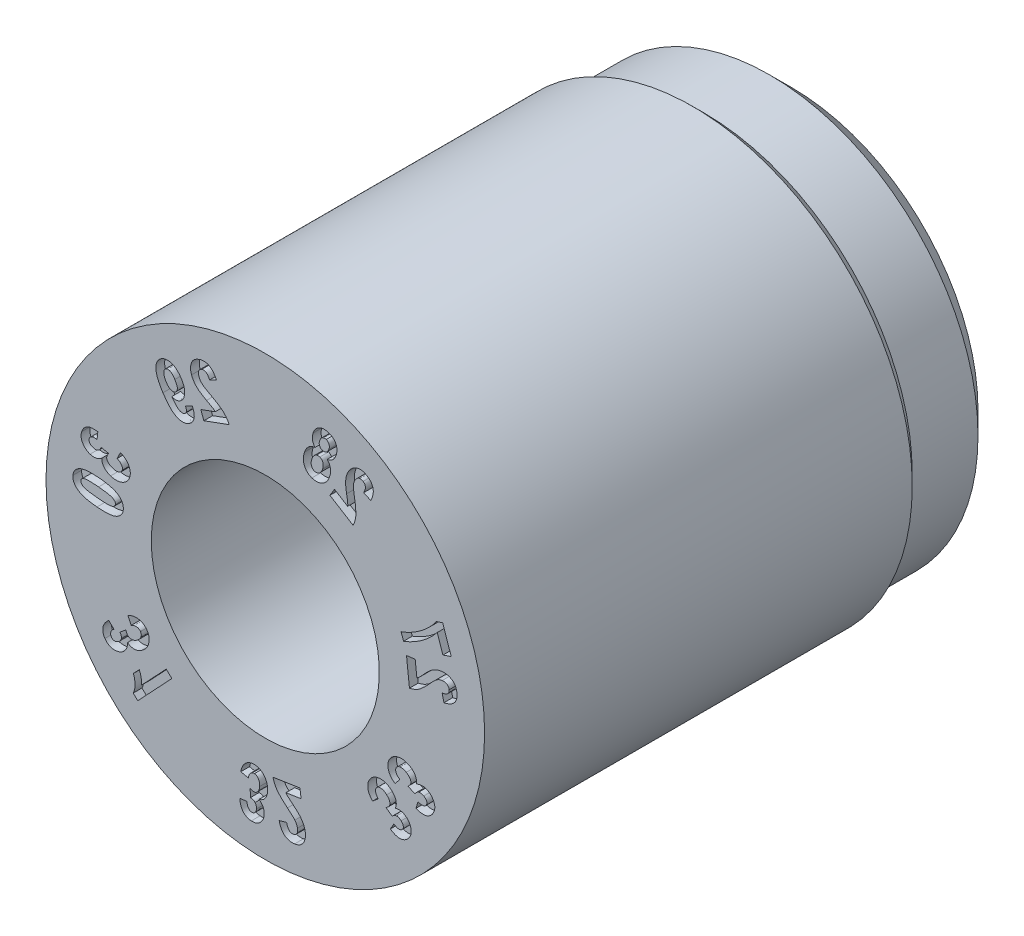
from build123d import *

# Parameters (mm, degrees)
CUT_EXTRUDE2_DEPTH = 0.2


with BuildPart() as part:
    # Sketch2 → Revolve1 (revolve)
    with BuildSketch(Plane(origin=(0, 0, 0), x_dir=(1, 0, 0), z_dir=(0, 1, 0)), mode=Mode.PRIVATE) as revolve1_sk:
        Polygon((4.249621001, 12), (1.25, 12), (1.25, 8.871), (2.6, 8.871), (2.6, 0), (5, 0), (5, 9.75), (4.75, 10), (4.75, 11.499621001), align=None)
    revolve(revolve1_sk.sketch.rotate(Axis((0, 0, -4.849143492), (0, 0, 1)), 180), axis=Axis((0, 0, -4.849143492), (0, 0, 1)))

    # Sketch8 → Cut-Extrude2 (cut)
    # profile 1 of 14: a face of its own
    with BuildSketch(Plane.XY):
        with BuildLine():
            Line((3.41791082, 0.667450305), (3.219495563, 0.645916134))
            Line((3.219495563, 0.645916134), (3.286152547, 0.031807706))
            add(Edge.make_bspline(
                [(3.286152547, 0.031807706), (3.304510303, 0.035905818), (3.341133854, 0.044081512), (3.394034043, 0.063133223), (3.445198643, 0.086410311), (3.486374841, 0.110327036), (3.519267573, 0.13310251), (3.545927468, 0.153148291), (3.57393366, 0.176696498), (3.60379043, 0.203239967), (3.634956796, 0.23336395), (3.668336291, 0.266096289), (3.702877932, 0.30254119), (3.7263109, 0.328010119), (3.738433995, 0.341186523)],
                knots=[0, 0, 0, 0, 1.210903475, 2.415741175, 3.614422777, 4.829304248, 5.477408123, 6.191639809, 6.977581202, 7.834306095, 8.765204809, 9.770030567, 10.846320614, 12, 12, 12, 12], degree=3))
            add(Edge.make_bspline(
                [(3.738433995, 0.341186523), (3.747932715, 0.351524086), (3.766061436, 0.371253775), (3.792304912, 0.399101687), (3.81602936, 0.423986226), (3.837827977, 0.4454302), (3.856680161, 0.46431144), (3.873398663, 0.479964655), (3.887739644, 0.492545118), (3.896889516, 0.499498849), (3.900964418, 0.502595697)],
                knots=[0, 0, 0, 0, 1.469359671, 2.804336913, 4.005076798, 5.067497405, 6.004650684, 6.797449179, 7.46444311, 8, 8, 8, 8], degree=3))
            add(Edge.make_bspline(
                [(3.900964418, 0.502595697), (3.911429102, 0.509879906), (3.931830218, 0.52408062), (3.964812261, 0.540124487), (3.998333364, 0.551568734), (4.021269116, 0.555146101), (4.032596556, 0.55691288)],
                knots=[0, 0, 0, 0, 1.061115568, 2.068666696, 3.046158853, 4, 4, 4, 4], degree=3))
            add(Edge.make_bspline(
                [(4.032596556, 0.55691288), (4.04409789, 0.557881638), (4.065787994, 0.559708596), (4.096639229, 0.556585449), (4.123668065, 0.549322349), (4.146524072, 0.537037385), (4.165185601, 0.521015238), (4.179263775, 0.50146271), (4.189091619, 0.478971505), (4.191641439, 0.462602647), (4.192952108, 0.454188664)],
                knots=[0, 0, 0, 0, 1.284830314, 2.42303217, 3.43989917, 4.386563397, 5.292301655, 6.158766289, 7.053562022, 8, 8, 8, 8], degree=3))
            add(Edge.make_bspline(
                [(4.192952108, 0.454188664), (4.193468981, 0.44496159), (4.194463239, 0.427212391), (4.188917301, 0.401419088), (4.176935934, 0.378661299), (4.159352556, 0.35867735), (4.135756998, 0.341847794), (4.106391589, 0.328390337), (4.071581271, 0.316917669), (4.04608235, 0.312246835), (4.032504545, 0.309759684)],
                knots=[0, 0, 0, 0, 0.913722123, 1.757635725, 2.579276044, 3.438933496, 4.37433614, 5.431505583, 6.632314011, 8, 8, 8, 8], degree=3))
            Line((4.032504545, 0.309759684), (4.07278273, 0.13827226))
            add(Edge.make_bspline(
                [(4.07278273, 0.13827226), (4.086328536, 0.141239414), (4.112636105, 0.14700198), (4.150348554, 0.158022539), (4.184935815, 0.171032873), (4.216633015, 0.185289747), (4.245186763, 0.201374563), (4.270754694, 0.219017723), (4.293242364, 0.238479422), (4.312705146, 0.259573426), (4.329225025, 0.282215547), (4.343234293, 0.306127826), (4.354488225, 0.331454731), (4.362756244, 0.358220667), (4.368898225, 0.386179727), (4.371880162, 0.415582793), (4.372107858, 0.446356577), (4.370372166, 0.467198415), (4.369481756, 0.477890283)],
                knots=[0, 0, 0, 0, 1.316678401, 2.557146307, 3.727226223, 4.823655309, 5.854584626, 6.835260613, 7.768888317, 8.673026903, 9.554907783, 10.425565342, 11.300463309, 12.180346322, 13.081818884, 14.014614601, 14.981496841, 16, 16, 16, 16], degree=3))
            add(Edge.make_bspline(
                [(4.369481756, 0.477890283), (4.367912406, 0.489480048), (4.364868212, 0.511961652), (4.357152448, 0.544353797), (4.346399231, 0.574026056), (4.333244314, 0.601433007), (4.31702778, 0.626017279), (4.298337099, 0.648379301), (4.276626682, 0.667856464), (4.252642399, 0.684772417), (4.227153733, 0.699330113), (4.200752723, 0.711410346), (4.173763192, 0.721161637), (4.146243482, 0.72871629), (4.118070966, 0.733597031), (4.089328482, 0.736500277), (4.059967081, 0.736820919), (4.040286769, 0.735084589), (4.030367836, 0.734209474)],
                knots=[0, 0, 0, 0, 1.173652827, 2.276629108, 3.335023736, 4.336619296, 5.321091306, 6.283820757, 7.254537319, 8.239831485, 9.225125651, 10.197062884, 11.150738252, 12.103199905, 13.057936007, 14.017536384, 15.000832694, 16, 16, 16, 16], degree=3))
            add(Edge.make_bspline(
                [(4.030367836, 0.734209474), (4.019060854, 0.732759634), (3.996552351, 0.729873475), (3.963492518, 0.722421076), (3.931136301, 0.712985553), (3.899437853, 0.701423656), (3.868295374, 0.687214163), (3.837439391, 0.670613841), (3.806707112, 0.651440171), (3.78120425, 0.633457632), (3.760411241, 0.617250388), (3.743932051, 0.602968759), (3.726375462, 0.587111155), (3.707907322, 0.569438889), (3.688330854, 0.550339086), (3.668050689, 0.529166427), (3.646624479, 0.506448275), (3.632187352, 0.490516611), (3.624777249, 0.482339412)],
                knots=[0, 0, 0, 0, 1.116805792, 2.223195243, 3.31725657, 4.418851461, 5.527133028, 6.669491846, 7.850789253, 9.075422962, 9.72636706, 10.433968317, 11.212223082, 12.045064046, 12.93920453, 13.892729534, 14.918407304, 16, 16, 16, 16], degree=3))
            add(Edge.make_bspline(
                [(3.624777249, 0.482339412), (3.617913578, 0.474773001), (3.604836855, 0.460357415), (3.58610794, 0.43988953), (3.568950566, 0.421809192), (3.554203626, 0.405303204), (3.540571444, 0.391619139), (3.529304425, 0.379595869), (3.519494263, 0.370082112), (3.504892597, 0.355989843), (3.484526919, 0.338247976), (3.464978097, 0.325560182), (3.455587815, 0.319465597)],
                knots=[0, 0, 0, 0, 1.30077431, 2.478245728, 3.532467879, 4.474445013, 5.295791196, 5.991390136, 6.572169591, 7.035389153, 8.575948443, 10, 10, 10, 10], degree=3))
            Line((3.455587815, 0.319465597), (3.41791082, 0.667450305))
        make_face()
    # profile 2 of 14: a face of its own
    with BuildSketch(Plane.XY):
        with BuildLine():
            Line((4.049917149, 1.068472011), (4.239032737, 1.13317265))
            Line((4.239032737, 1.13317265), (4.043600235, 1.704089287))
            Line((4.043600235, 1.704089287), (3.895805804, 1.653603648))
            add(Edge.make_bspline(
                [(3.895805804, 1.653603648), (3.890456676, 1.645104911), (3.879462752, 1.627637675), (3.860630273, 1.601760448), (3.840096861, 1.574783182), (3.816889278, 1.54720262), (3.791918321, 1.518512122), (3.764408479, 1.489254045), (3.73483181, 1.459136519), (3.692368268, 1.417705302), (3.635941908, 1.366709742), (3.563880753, 1.308450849), (3.487387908, 1.253738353), (3.421010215, 1.210601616), (3.366546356, 1.178535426), (3.32637614, 1.15542831), (3.286477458, 1.134504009), (3.247411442, 1.114709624), (3.208891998, 1.09659131), (3.170924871, 1.080144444), (3.133659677, 1.06516968), (3.108762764, 1.056416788), (3.096511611, 1.052109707)],
                knots=[0, 0, 0, 0, 0.592925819, 1.218625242, 1.889308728, 2.594945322, 3.346961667, 4.135506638, 4.966343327, 5.83992233, 7.639133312, 9.456054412, 11.30963279, 13.191274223, 14.129172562, 15.042249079, 15.927901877, 16.789598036, 17.628694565, 18.441505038, 19.233103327, 20, 20, 20, 20], degree=3))
            Line((3.096511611, 1.052109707), (3.151524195, 0.891432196))
            add(Edge.make_bspline(
                [(3.151524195, 0.891432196), (3.1701605, 0.898473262), (3.207518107, 0.912587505), (3.262363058, 0.936836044), (3.316776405, 0.962437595), (3.37036645, 0.990204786), (3.423123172, 1.020055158), (3.475460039, 1.05145938), (3.526674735, 1.085414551), (3.577287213, 1.120808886), (3.62654246, 1.157860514), (3.674009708, 1.19620846), (3.719929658, 1.235359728), (3.763548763, 1.275938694), (3.80550971, 1.317428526), (3.845790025, 1.359703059), (3.883849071, 1.403362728), (3.907918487, 1.433324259), (3.919900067, 1.448238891)],
                knots=[0, 0, 0, 0, 0.995463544, 1.995467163, 2.995843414, 4.000594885, 5.010980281, 6.024906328, 7.050248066, 8.081250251, 9.111188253, 10.129832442, 11.130581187, 12.126361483, 13.106449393, 14.079395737, 15.043937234, 16, 16, 16, 16], degree=3))
            Line((3.919900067, 1.448238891), (4.049917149, 1.068472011))
        make_face()
    # profile 3 of 14: a face of its own
    with BuildSketch(Plane.XY):
        with BuildLine():
            Line((1.578489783, 3.104840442), (1.472705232, 2.934167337))
            Line((1.472705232, 2.934167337), (2.001447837, 2.606572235))
            add(Edge.make_bspline(
                [(2.001447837, 2.606572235), (2.009576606, 2.623699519), (2.025750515, 2.657777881), (2.043611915, 2.711494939), (2.05660476, 2.766531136), (2.063474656, 2.814001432), (2.06564037, 2.854189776), (2.066179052, 2.887763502), (2.064699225, 2.92458036), (2.062179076, 2.964795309), (2.058055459, 3.008261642), (2.052459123, 3.055024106), (2.045200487, 3.104988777), (2.039545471, 3.13934067), (2.036622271, 3.157097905)],
                knots=[0, 0, 0, 0, 1.212546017, 2.412617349, 3.614597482, 4.829081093, 5.476239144, 6.189721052, 6.977489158, 7.83390085, 8.768655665, 9.771664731, 10.848125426, 12, 12, 12, 12], degree=3))
            add(Edge.make_bspline(
                [(2.036622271, 3.157097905), (2.034287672, 3.17099493), (2.029821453, 3.197580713), (2.023866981, 3.235648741), (2.019077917, 3.270009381), (2.015137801, 3.300519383), (2.012010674, 3.327184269), (2.010023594, 3.350070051), (2.009123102, 3.369237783), (2.009191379, 3.380765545), (2.009221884, 3.385915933)],
                knots=[0, 0, 0, 0, 1.465955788, 2.804454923, 4.008189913, 5.074897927, 6.004758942, 6.800898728, 7.464264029, 8, 8, 8, 8], degree=3))
            add(Edge.make_bspline(
                [(2.009221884, 3.385915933), (2.00986678, 3.398796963), (2.011125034, 3.423929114), (2.019055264, 3.460043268), (2.030470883, 3.493808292), (2.041976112, 3.514050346), (2.047671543, 3.524070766)],
                knots=[0, 0, 0, 0, 1.065063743, 2.0780436, 3.048574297, 4, 4, 4, 4], degree=3))
            add(Edge.make_bspline(
                [(2.047671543, 3.524070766), (2.054035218, 3.533744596), (2.066085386, 3.552062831), (2.08754902, 3.574713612), (2.110057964, 3.591759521), (2.133894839, 3.602254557), (2.158168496, 3.607081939), (2.1823862, 3.606359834), (2.206337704, 3.600034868), (2.220887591, 3.591942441), (2.228378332, 3.587776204)],
                knots=[0, 0, 0, 0, 1.280992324, 2.42566981, 3.440082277, 4.389618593, 5.285658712, 6.160689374, 7.053064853, 8, 8, 8, 8], degree=3))
            add(Edge.make_bspline(
                [(2.228378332, 3.587776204), (2.236021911, 3.582450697), (2.250715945, 3.572212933), (2.267705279, 3.551722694), (2.278526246, 3.528175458), (2.283179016, 3.501747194), (2.282143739, 3.472714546), (2.27469946, 3.441026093), (2.261889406, 3.406507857), (2.249835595, 3.383387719), (2.243434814, 3.371110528)],
                knots=[0, 0, 0, 0, 0.915025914, 1.759047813, 2.58820678, 3.441590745, 4.38025935, 5.432150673, 6.636427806, 8, 8, 8, 8], degree=3))
            Line((2.243434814, 3.371110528), (2.404799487, 3.296471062))
            add(Edge.make_bspline(
                [(2.404799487, 3.296471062), (2.4108425, 3.309112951), (2.42253086, 3.333564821), (2.437014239, 3.370377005), (2.448420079, 3.405747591), (2.456610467, 3.439746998), (2.461606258, 3.472334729), (2.463164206, 3.503550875), (2.461795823, 3.533482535), (2.457081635, 3.562057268), (2.449505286, 3.589342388), (2.438937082, 3.615246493), (2.425782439, 3.639849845), (2.409852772, 3.663141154), (2.391335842, 3.685297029), (2.36978875, 3.705886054), (2.345749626, 3.725362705), (2.328141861, 3.736814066), (2.319148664, 3.742662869)],
                knots=[0, 0, 0, 0, 1.321020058, 2.555109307, 3.727263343, 4.82308446, 5.849648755, 6.831513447, 7.765834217, 8.66978092, 9.556713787, 10.430661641, 11.302709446, 12.182709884, 13.087192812, 14.02044777, 14.988940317, 16, 16, 16, 16], degree=3))
            add(Edge.make_bspline(
                [(2.319148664, 3.742662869), (2.308963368, 3.748559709), (2.289131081, 3.760041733), (2.258706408, 3.774197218), (2.22827567, 3.783748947), (2.198428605, 3.790430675), (2.168751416, 3.792750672), (2.139490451, 3.792018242), (2.110579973, 3.786789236), (2.082358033, 3.778292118), (2.055091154, 3.766973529), (2.029085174, 3.753691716), (2.004682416, 3.738238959), (1.981605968, 3.721053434), (1.960108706, 3.701832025), (1.940392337, 3.680404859), (1.921692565, 3.657469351), (1.910909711, 3.64071727), (1.90546894, 3.63226457)],
                knots=[0, 0, 0, 0, 1.172570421, 2.283168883, 3.334839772, 4.34519608, 5.323924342, 6.293527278, 7.253740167, 8.241595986, 9.225289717, 10.191654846, 11.147853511, 12.0998714, 13.055921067, 14.016311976, 14.999078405, 16, 16, 16, 16], degree=3))
            add(Edge.make_bspline(
                [(1.90546894, 3.63226457), (1.899570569, 3.622418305), (1.887844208, 3.602843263), (1.873146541, 3.571993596), (1.860565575, 3.540486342), (1.850280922, 3.508019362), (1.842206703, 3.474533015), (1.836223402, 3.439657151), (1.832465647, 3.403377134), (1.831077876, 3.37198165), (1.831004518, 3.345462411), (1.832045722, 3.323565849), (1.833632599, 3.299865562), (1.836048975, 3.274288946), (1.839592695, 3.246956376), (1.843629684, 3.21776705), (1.848179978, 3.18670581), (1.851925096, 3.165464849), (1.853860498, 3.154487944)],
                knots=[0, 0, 0, 0, 1.117038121, 2.220747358, 3.322803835, 4.418348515, 5.533753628, 6.674267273, 7.861210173, 9.082785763, 9.732666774, 10.442685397, 11.216649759, 12.045474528, 12.943615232, 13.89999611, 14.914759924, 16, 16, 16, 16], degree=3))
            add(Edge.make_bspline(
                [(1.853860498, 3.154487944), (1.855692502, 3.144391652), (1.859180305, 3.125170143), (1.863400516, 3.097566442), (1.867812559, 3.072889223), (1.870856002, 3.05078649), (1.873926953, 3.031600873), (1.876262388, 3.015062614), (1.87775235, 3.001313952), (1.879825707, 2.980897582), (1.881028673, 2.953725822), (1.879104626, 2.930314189), (1.878181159, 2.919077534)],
                knots=[0, 0, 0, 0, 1.296454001, 2.468213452, 3.528090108, 4.463472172, 5.28690078, 5.983107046, 6.573562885, 7.034022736, 8.576448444, 10, 10, 10, 10], degree=3))
            Line((1.878181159, 2.919077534), (1.578489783, 3.104840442))
        make_face()
    # profile 4 of 14: a face of its own
    with BuildSketch(Plane.XY):
        with BuildLine():
            add(Edge.make_bspline(
                [(1.412620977, 3.613293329), (1.424324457, 3.61548375), (1.447281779, 3.619780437), (1.479789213, 3.63148528), (1.509444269, 3.64740842), (1.536163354, 3.6676324), (1.560116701, 3.692052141), (1.580806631, 3.720897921), (1.598869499, 3.753647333), (1.607964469, 3.777531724), (1.612653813, 3.789846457)],
                knots=[0, 0, 0, 0, 1.012172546, 1.985458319, 2.926955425, 3.866905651, 4.826770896, 5.826960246, 6.879586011, 8, 8, 8, 8], degree=3))
            add(Edge.make_bspline(
                [(1.612653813, 3.789846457), (1.616052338, 3.800096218), (1.622684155, 3.820097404), (1.629189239, 3.850360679), (1.633375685, 3.879761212), (1.634444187, 3.908357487), (1.633156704, 3.936113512), (1.628575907, 3.96291301), (1.621475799, 3.988984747), (1.611588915, 4.014092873), (1.599020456, 4.037841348), (1.584292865, 4.060064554), (1.566946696, 4.08034418), (1.547416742, 4.098992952), (1.525387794, 4.115737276), (1.500979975, 4.130459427), (1.474371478, 4.143654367), (1.455476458, 4.150800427), (1.445786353, 4.154465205)],
                knots=[0, 0, 0, 0, 1.143314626, 2.23104236, 3.274483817, 4.28594678, 5.258475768, 6.213052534, 7.160210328, 8.116978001, 9.065597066, 10.002221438, 10.935676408, 11.886906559, 12.858242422, 13.860780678, 14.902924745, 16, 16, 16, 16], degree=3))
            add(Edge.make_bspline(
                [(1.445786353, 4.154465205), (1.435377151, 4.157766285), (1.41514709, 4.164181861), (1.384741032, 4.170799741), (1.355326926, 4.173911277), (1.326888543, 4.174315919), (1.299451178, 4.171300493), (1.273171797, 4.164764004), (1.247705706, 4.15579822), (1.223765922, 4.142991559), (1.201085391, 4.128100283), (1.179983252, 4.11131751), (1.160632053, 4.09275724), (1.1431652, 4.072238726), (1.12699171, 4.050185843), (1.113139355, 4.02593203), (1.10043914, 4.000239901), (1.093750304, 3.982052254), (1.090356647, 3.972824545)],
                knots=[0, 0, 0, 0, 1.163481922, 2.261202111, 3.309622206, 4.310939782, 5.287237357, 6.24182584, 7.191827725, 8.156740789, 9.126976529, 10.080745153, 11.026207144, 11.979804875, 12.949536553, 13.936096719, 14.952855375, 16, 16, 16, 16], degree=3))
            add(Edge.make_bspline(
                [(1.090356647, 3.972824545), (1.086360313, 3.960173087), (1.078580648, 3.935544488), (1.072559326, 3.898182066), (1.070961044, 3.862009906), (1.075042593, 3.827322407), (1.083404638, 3.794440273), (1.096031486, 3.763839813), (1.112468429, 3.735239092), (1.126672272, 3.718566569), (1.133847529, 3.710144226)],
                knots=[0, 0, 0, 0, 1.134971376, 2.209449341, 3.230758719, 4.226332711, 5.189212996, 6.127582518, 7.05412376, 8, 8, 8, 8], degree=3))
            add(Edge.make_bspline(
                [(1.133847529, 3.710144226), (1.119819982, 3.707948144), (1.092400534, 3.703655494), (1.053553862, 3.690203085), (1.018015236, 3.671777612), (0.986145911, 3.647569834), (0.957838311, 3.61808344), (0.932687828, 3.583489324), (0.911067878, 3.543356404), (0.899982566, 3.514032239), (0.894230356, 3.498815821)],
                knots=[0, 0, 0, 0, 1.003893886, 1.962297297, 2.896563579, 3.828330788, 4.78288191, 5.78152899, 6.848827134, 8, 8, 8, 8], degree=3))
            add(Edge.make_bspline(
                [(0.894230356, 3.498815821), (0.889010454, 3.482757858), (0.878829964, 3.451439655), (0.870368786, 3.403831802), (0.866950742, 3.357594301), (0.869373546, 3.312926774), (0.876700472, 3.270392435), (0.889860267, 3.230840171), (0.907449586, 3.194229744), (0.930523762, 3.161349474), (0.957728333, 3.132302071), (0.988994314, 3.107465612), (1.023863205, 3.086680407), (1.049375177, 3.076857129), (1.062310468, 3.071876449)],
                knots=[0, 0, 0, 0, 1.179195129, 2.299810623, 3.370701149, 4.41398221, 5.419420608, 6.37861497, 7.319026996, 8.248880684, 9.175410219, 10.09166538, 11.032420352, 12, 12, 12, 12], degree=3))
            add(Edge.make_bspline(
                [(1.062310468, 3.071876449), (1.072654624, 3.068595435), (1.093047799, 3.062127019), (1.12408306, 3.055915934), (1.15469519, 3.053072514), (1.184882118, 3.053066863), (1.214590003, 3.056638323), (1.243940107, 3.063410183), (1.272825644, 3.073292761), (1.301107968, 3.086381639), (1.328195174, 3.102440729), (1.353594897, 3.121411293), (1.377191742, 3.143047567), (1.398496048, 3.16786495), (1.418365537, 3.195036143), (1.435912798, 3.225271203), (1.451426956, 3.258280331), (1.46016017, 3.281583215), (1.464635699, 3.293525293)],
                knots=[0, 0, 0, 0, 1.008189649, 1.987613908, 2.934944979, 3.862038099, 4.788194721, 5.709789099, 6.65712017, 7.620798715, 8.601614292, 9.578681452, 10.56272739, 11.570917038, 12.613966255, 13.687518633, 14.814917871, 16, 16, 16, 16], degree=3))
            add(Edge.make_bspline(
                [(1.464635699, 3.293525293), (1.46959772, 3.309015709), (1.479218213, 3.339048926), (1.486939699, 3.384598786), (1.489175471, 3.428396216), (1.485159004, 3.470420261), (1.475718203, 3.51040222), (1.460316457, 3.547765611), (1.439623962, 3.582722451), (1.421717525, 3.602994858), (1.412620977, 3.613293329)],
                knots=[0, 0, 0, 0, 1.140493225, 2.21121769, 3.232402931, 4.210277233, 5.164501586, 6.105041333, 7.037352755, 8, 8, 8, 8], degree=3))
        make_face()
        with BuildLine():
            add(Edge.make_bspline(
                [(1.449809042, 3.829998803), (1.446113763, 3.820276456), (1.439131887, 3.801907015), (1.424573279, 3.777647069), (1.407478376, 3.758271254), (1.388024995, 3.743894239), (1.36706777, 3.734668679), (1.345368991, 3.730495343), (1.323138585, 3.730852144), (1.308874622, 3.734964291), (1.30155177, 3.737075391)],
                knots=[0, 0, 0, 0, 1.266329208, 2.392607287, 3.429211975, 4.397375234, 5.318939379, 6.19663583, 7.07418644, 8, 8, 8, 8], degree=3))
            add(Edge.make_bspline(
                [(1.30155177, 3.737075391), (1.294361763, 3.739969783), (1.280323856, 3.745620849), (1.262498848, 3.759454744), (1.247749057, 3.776245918), (1.237054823, 3.796626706), (1.230032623, 3.819797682), (1.228903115, 3.845699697), (1.232309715, 3.873728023), (1.23815755, 3.892547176), (1.241236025, 3.902454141)],
                knots=[0, 0, 0, 0, 0.935410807, 1.826313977, 2.705162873, 3.626358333, 4.594547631, 5.615636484, 6.744799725, 8, 8, 8, 8], degree=3))
            add(Edge.make_bspline(
                [(1.241236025, 3.902454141), (1.244871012, 3.911845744), (1.251788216, 3.929717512), (1.266181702, 3.953206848), (1.282904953, 3.972356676), (1.302425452, 3.986096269), (1.323130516, 3.995567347), (1.344682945, 4.000094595), (1.366787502, 3.999902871), (1.380872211, 3.995730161), (1.388085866, 3.993593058)],
                knots=[0, 0, 0, 0, 1.243963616, 2.367202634, 3.391109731, 4.367166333, 5.298014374, 6.189808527, 7.072888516, 8, 8, 8, 8], degree=3))
            add(Edge.make_bspline(
                [(1.388085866, 3.993593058), (1.39537694, 3.99058049), (1.409483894, 3.984751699), (1.427836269, 3.971102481), (1.442528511, 3.953949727), (1.453130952, 3.933380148), (1.459864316, 3.9103011), (1.461441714, 3.884932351), (1.458445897, 3.857652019), (1.452780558, 3.839512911), (1.449809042, 3.829998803)],
                knots=[0, 0, 0, 0, 0.961084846, 1.85953116, 2.765529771, 3.698008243, 4.666599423, 5.682314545, 6.784355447, 8, 8, 8, 8], degree=3))
        make_face(mode=Mode.SUBTRACT)
        with BuildLine():
            add(Edge.make_bspline(
                [(1.30686212, 3.370201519), (1.304335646, 3.363344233), (1.299401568, 3.349952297), (1.291128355, 3.330830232), (1.281703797, 3.313537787), (1.272000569, 3.29771658), (1.261462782, 3.283543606), (1.250120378, 3.271101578), (1.238291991, 3.259884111), (1.221602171, 3.248014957), (1.200282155, 3.236579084), (1.173819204, 3.229266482), (1.147296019, 3.227835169), (1.130605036, 3.232458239), (1.122197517, 3.234786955)],
                knots=[0, 0, 0, 0, 1.031174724, 2.013832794, 2.936515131, 3.807726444, 4.631127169, 5.42398422, 6.181460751, 6.925926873, 8.308731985, 9.570186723, 10.776063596, 12, 12, 12, 12], degree=3))
            add(Edge.make_bspline(
                [(1.122197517, 3.234786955), (1.11414459, 3.238169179), (1.098301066, 3.244823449), (1.078280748, 3.26155581), (1.062365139, 3.282802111), (1.053113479, 3.303986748), (1.047878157, 3.3228548), (1.045415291, 3.33846762), (1.04461268, 3.355131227), (1.045609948, 3.37273968), (1.047703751, 3.391368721), (1.051719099, 3.410966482), (1.056947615, 3.431618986), (1.061561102, 3.445529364), (1.063931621, 3.452676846)],
                knots=[0, 0, 0, 0, 1.239140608, 2.437915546, 3.666282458, 4.994483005, 5.705022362, 6.453910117, 7.242165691, 8.078158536, 8.965240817, 9.911778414, 10.927022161, 12, 12, 12, 12], degree=3))
            add(Edge.make_bspline(
                [(1.063931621, 3.452676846), (1.068513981, 3.464581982), (1.077247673, 3.487272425), (1.095179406, 3.517477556), (1.115878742, 3.542491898), (1.139790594, 3.561220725), (1.165066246, 3.574338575), (1.191084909, 3.581363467), (1.217523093, 3.582048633), (1.23422364, 3.57743372), (1.24268763, 3.57509484)],
                knots=[0, 0, 0, 0, 1.265718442, 2.412379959, 3.474500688, 4.473264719, 5.409681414, 6.285946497, 7.131302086, 8, 8, 8, 8], degree=3))
            add(Edge.make_bspline(
                [(1.24268763, 3.57509484), (1.250691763, 3.571773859), (1.266577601, 3.565182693), (1.286474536, 3.548111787), (1.302464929, 3.52643592), (1.313952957, 3.500367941), (1.321193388, 3.470922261), (1.321899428, 3.438864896), (1.317697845, 3.404715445), (1.310581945, 3.382049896), (1.30686212, 3.370201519)],
                knots=[0, 0, 0, 0, 0.865733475, 1.718225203, 2.593105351, 3.552780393, 4.560480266, 5.618514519, 6.755082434, 8, 8, 8, 8], degree=3))
        make_face(mode=Mode.SUBTRACT)
    # profile 5 of 14: a face of its own
    with BuildSketch(Plane.XY):
        with BuildLine():
            Line((-1.469755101, 3.156632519), (-1.401136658, 2.969353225))
            Line((-1.401136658, 2.969353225), (-0.821803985, 3.181979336))
            add(Edge.make_bspline(
                [(-0.821803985, 3.181979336), (-0.830284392, 3.198733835), (-0.847184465, 3.23212283), (-0.877881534, 3.279161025), (-0.912984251, 3.323019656), (-0.945986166, 3.357269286), (-0.975699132, 3.384009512), (-1.001729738, 3.404801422), (-1.031405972, 3.426140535), (-1.0641833, 3.448827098), (-1.10069138, 3.47211054), (-1.140816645, 3.496148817), (-1.184293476, 3.52122664), (-1.214659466, 3.537794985), (-1.23032071, 3.5463401)],
                knots=[0, 0, 0, 0, 1.210515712, 2.412361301, 3.614882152, 4.829208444, 5.475330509, 6.192138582, 6.976693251, 7.832524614, 8.762980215, 9.768909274, 10.849316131, 12, 12, 12, 12], degree=3))
            add(Edge.make_bspline(
                [(-1.23032071, 3.5463401), (-1.242606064, 3.553110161), (-1.266019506, 3.566012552), (-1.299491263, 3.584499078), (-1.329172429, 3.601871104), (-1.355506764, 3.617308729), (-1.378114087, 3.631367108), (-1.397295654, 3.643651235), (-1.412916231, 3.654570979), (-1.421907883, 3.661663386), (-1.425921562, 3.664829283)],
                knots=[0, 0, 0, 0, 1.470658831, 2.80278305, 4.008638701, 5.076165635, 6.002996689, 6.799511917, 7.464128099, 8, 8, 8, 8], degree=3))
            add(Edge.make_bspline(
                [(-1.425921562, 3.664829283), (-1.435550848, 3.673215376), (-1.454333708, 3.689573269), (-1.477867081, 3.717627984), (-1.497160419, 3.747332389), (-1.506012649, 3.768752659), (-1.510416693, 3.779409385)],
                knots=[0, 0, 0, 0, 1.062461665, 2.072435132, 3.041023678, 4, 4, 4, 4], degree=3))
            add(Edge.make_bspline(
                [(-1.510416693, 3.779409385), (-1.513976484, 3.790350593), (-1.520693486, 3.810995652), (-1.525951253, 3.841604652), (-1.524816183, 3.869615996), (-1.518652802, 3.8947547), (-1.50746811, 3.916655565), (-1.492096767, 3.935111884), (-1.472647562, 3.950234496), (-1.457367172, 3.956639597), (-1.449457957, 3.959954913)],
                knots=[0, 0, 0, 0, 1.282345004, 2.41966796, 3.441994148, 4.386716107, 5.284135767, 6.159127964, 7.047154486, 8, 8, 8, 8], degree=3))
            add(Edge.make_bspline(
                [(-1.449457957, 3.959954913), (-1.440592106, 3.962715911), (-1.423618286, 3.968001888), (-1.397269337, 3.968642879), (-1.372275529, 3.962735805), (-1.34877665, 3.95011688), (-1.326850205, 3.931288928), (-1.30638426, 3.906308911), (-1.287418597, 3.875080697), (-1.276794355, 3.851535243), (-1.271152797, 3.83903242)],
                knots=[0, 0, 0, 0, 0.918840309, 1.759134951, 2.582409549, 3.443210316, 4.382198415, 5.435747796, 6.638361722, 8, 8, 8, 8], degree=3))
            Line((-1.271152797, 3.83903242), (-1.114198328, 3.919200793))
            add(Edge.make_bspline(
                [(-1.114198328, 3.919200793), (-1.120338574, 3.931624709), (-1.132274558, 3.955775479), (-1.152027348, 3.989668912), (-1.172654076, 4.020264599), (-1.194414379, 4.047244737), (-1.216598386, 4.071323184), (-1.239924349, 4.091919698), (-1.264271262, 4.109033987), (-1.289452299, 4.122902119), (-1.31547044, 4.133401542), (-1.342055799, 4.141132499), (-1.369323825, 4.146119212), (-1.397253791, 4.147595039), (-1.425917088, 4.146610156), (-1.455207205, 4.142554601), (-1.485159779, 4.135421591), (-1.504942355, 4.128772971), (-1.515054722, 4.12537436)],
                knots=[0, 0, 0, 0, 1.316257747, 2.558665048, 3.723835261, 4.818168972, 5.848582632, 6.830791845, 7.76820878, 8.670401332, 9.555670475, 10.42797226, 11.296942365, 12.182679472, 13.079661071, 14.018044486, 14.986873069, 16, 16, 16, 16], degree=3))
            add(Edge.make_bspline(
                [(-1.515054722, 4.12537436), (-1.525952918, 4.12111489), (-1.547114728, 4.112843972), (-1.576397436, 4.097155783), (-1.602831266, 4.07985959), (-1.625987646, 4.060214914), (-1.646165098, 4.03870478), (-1.663307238, 4.015274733), (-1.677146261, 3.989666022), (-1.687589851, 3.962285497), (-1.6953099, 3.933998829), (-1.700724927, 3.905543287), (-1.703999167, 3.87707123), (-1.704606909, 3.848558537), (-1.702465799, 3.819994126), (-1.698329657, 3.791394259), (-1.691470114, 3.762776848), (-1.685079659, 3.74408568), (-1.68184704, 3.734630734)],
                knots=[0, 0, 0, 0, 1.174246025, 2.280117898, 3.329584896, 4.341532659, 5.322101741, 6.285397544, 7.249023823, 8.236388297, 9.2219335, 10.190383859, 11.143043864, 12.097161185, 13.04982119, 14.016835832, 14.996814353, 16, 16, 16, 16], degree=3))
            add(Edge.make_bspline(
                [(-1.68184704, 3.734630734), (-1.677730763, 3.723989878), (-1.669555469, 3.702856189), (-1.654419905, 3.672580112), (-1.637691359, 3.643414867), (-1.618522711, 3.615624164), (-1.597309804, 3.588821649), (-1.573784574, 3.562768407), (-1.547697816, 3.537731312), (-1.524028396, 3.517390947), (-1.503329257, 3.501203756), (-1.485650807, 3.488597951), (-1.46616814, 3.47539298), (-1.44464075, 3.461671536), (-1.421277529, 3.447429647), (-1.396088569, 3.432447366), (-1.368868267, 3.417217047), (-1.349950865, 3.407031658), (-1.340214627, 3.401789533)],
                knots=[0, 0, 0, 0, 1.118947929, 2.222330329, 3.317392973, 4.415806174, 5.531465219, 6.669412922, 7.857324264, 9.076978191, 9.730120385, 10.43505914, 11.207008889, 12.039372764, 12.939697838, 13.891808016, 14.914974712, 16, 16, 16, 16], degree=3))
            add(Edge.make_bspline(
                [(-1.340214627, 3.401789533), (-1.331251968, 3.396980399), (-1.314132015, 3.387794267), (-1.2898666, 3.37437383), (-1.26784219, 3.362717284), (-1.24859592, 3.351840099), (-1.231854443, 3.342298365), (-1.217673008, 3.333894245), (-1.205769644, 3.327136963), (-1.188771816, 3.316017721), (-1.166757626, 3.300426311), (-1.149528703, 3.284749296), (-1.141249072, 3.277215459)],
                knots=[0, 0, 0, 0, 1.295832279, 2.475224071, 3.53267958, 4.470276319, 5.291569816, 5.987556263, 6.570579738, 7.034659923, 8.574959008, 10, 10, 10, 10], degree=3))
            Line((-1.141249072, 3.277215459), (-1.469755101, 3.156632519))
        make_face()
    # profile 6 of 14: a face of its own
    with BuildSketch(Plane.XY):
        with BuildLine():
            Line((-1.666082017, 3.127276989), (-1.822578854, 3.053587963))
            add(Edge.make_bspline(
                [(-1.822578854, 3.053587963), (-1.818281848, 3.044682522), (-1.810182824, 3.02789749), (-1.801934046, 3.002760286), (-1.797112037, 2.979659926), (-1.797010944, 2.958315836), (-1.800998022, 2.938836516), (-1.80942512, 2.921438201), (-1.82197188, 2.906030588), (-1.832853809, 2.898224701), (-1.838490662, 2.894181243)],
                knots=[0, 0, 0, 0, 1.329281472, 2.505438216, 3.551966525, 4.491910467, 5.357776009, 6.204216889, 7.069782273, 8, 8, 8, 8], degree=3))
            add(Edge.make_bspline(
                [(-1.838490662, 2.894181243), (-1.842638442, 2.891714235), (-1.850844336, 2.88683355), (-1.864273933, 2.881846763), (-1.8781671, 2.878887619), (-1.892479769, 2.877731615), (-1.90727564, 2.878988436), (-1.922596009, 2.881847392), (-1.938307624, 2.88713489), (-1.954827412, 2.894220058), (-1.972202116, 2.904489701), (-1.990858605, 2.918383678), (-2.010967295, 2.936024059), (-2.032467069, 2.957715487), (-2.055575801, 2.983067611), (-2.079904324, 3.012489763), (-2.106017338, 3.045426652), (-2.123399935, 3.069042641), (-2.132486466, 3.081387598)],
                knots=[0, 0, 0, 0, 0.605974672, 1.198849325, 1.791494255, 2.388412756, 2.997301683, 3.653618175, 4.343845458, 5.077552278, 5.910899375, 6.875144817, 7.99947226, 9.271860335, 10.714347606, 12.31235975, 14.07233307, 16, 16, 16, 16], degree=3))
            add(Edge.make_bspline(
                [(-2.132486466, 3.081387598), (-2.123819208, 3.078061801), (-2.106931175, 3.071581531), (-2.08115256, 3.065620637), (-2.05612123, 3.062254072), (-2.031747, 3.06192686), (-2.007923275, 3.064762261), (-1.984849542, 3.071000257), (-1.962275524, 3.080078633), (-1.948223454, 3.088430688), (-1.941089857, 3.092670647)],
                knots=[0, 0, 0, 0, 1.113580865, 2.169797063, 3.16837825, 4.141948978, 5.088976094, 6.039492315, 7.004739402, 8, 8, 8, 8], degree=3))
            add(Edge.make_bspline(
                [(-1.941089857, 3.092670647), (-1.933972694, 3.097660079), (-1.919867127, 3.107548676), (-1.901080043, 3.125300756), (-1.884701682, 3.145309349), (-1.871040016, 3.167733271), (-1.859173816, 3.192047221), (-1.849982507, 3.218759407), (-1.843319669, 3.247753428), (-1.838690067, 3.278623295), (-1.837036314, 3.310809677), (-1.83854608, 3.343654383), (-1.84328871, 3.376835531), (-1.851696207, 3.410317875), (-1.862611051, 3.444329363), (-1.877483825, 3.478456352), (-1.895278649, 3.51300745), (-1.909201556, 3.535563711), (-1.916323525, 3.54710189)],
                knots=[0, 0, 0, 0, 0.826288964, 1.637629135, 2.450793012, 3.279751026, 4.130737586, 5.021035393, 5.961277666, 6.95849982, 7.988034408, 9.023006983, 10.082988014, 11.171825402, 12.304691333, 13.47830003, 14.710077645, 16, 16, 16, 16], degree=3))
            add(Edge.make_bspline(
                [(-1.916323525, 3.54710189), (-1.924434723, 3.559094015), (-1.940236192, 3.582455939), (-1.96594699, 3.614826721), (-1.992433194, 3.643877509), (-2.019965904, 3.669475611), (-2.048643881, 3.691421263), (-2.078155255, 3.710155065), (-2.108728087, 3.725197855), (-2.139913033, 3.736773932), (-2.171207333, 3.74506602), (-2.202206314, 3.749643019), (-2.232463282, 3.75160912), (-2.262074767, 3.749449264), (-2.291072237, 3.744383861), (-2.319232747, 3.735420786), (-2.346933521, 3.723673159), (-2.364175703, 3.713135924), (-2.37294111, 3.70777911)],
                knots=[0, 0, 0, 0, 1.282380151, 2.498211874, 3.658971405, 4.762728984, 5.824289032, 6.854247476, 7.854940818, 8.837230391, 9.797274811, 10.717445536, 11.609952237, 12.477811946, 13.341717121, 14.211858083, 15.090962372, 16, 16, 16, 16], degree=3))
            add(Edge.make_bspline(
                [(-2.37294111, 3.70777911), (-2.382332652, 3.70129154), (-2.400881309, 3.688478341), (-2.424983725, 3.665169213), (-2.445797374, 3.639492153), (-2.462877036, 3.611029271), (-2.476268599, 3.579900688), (-2.486524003, 3.546312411), (-2.49254346, 3.510025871), (-2.495694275, 3.471150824), (-2.494241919, 3.42931253), (-2.487147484, 3.384581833), (-2.474494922, 3.337006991), (-2.457343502, 3.28618381), (-2.433931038, 3.232725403), (-2.405855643, 3.176064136), (-2.372240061, 3.116483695), (-2.346997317, 3.076452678), (-2.333894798, 3.055674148)],
                knots=[0, 0, 0, 0, 0.750151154, 1.481577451, 2.197476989, 2.920425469, 3.658398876, 4.422780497, 5.225734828, 6.074267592, 6.986242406, 7.973642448, 9.04819468, 10.222836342, 11.500323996, 12.885646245, 14.383461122, 16, 16, 16, 16], degree=3))
            add(Edge.make_bspline(
                [(-2.333894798, 3.055674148), (-2.320049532, 3.034858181), (-2.293354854, 2.994723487), (-2.252200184, 2.938401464), (-2.210985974, 2.888701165), (-2.170819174, 2.844645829), (-2.130621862, 2.807252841), (-2.091255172, 2.775532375), (-2.051910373, 2.750428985), (-2.013148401, 2.731191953), (-1.974887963, 2.717899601), (-1.937647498, 2.708603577), (-1.901156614, 2.704061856), (-1.86545548, 2.704114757), (-1.830593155, 2.708502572), (-1.796617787, 2.718036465), (-1.763419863, 2.731821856), (-1.742619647, 2.744249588), (-1.732046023, 2.750567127)],
                knots=[0, 0, 0, 0, 1.587901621, 3.061589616, 4.428159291, 5.687453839, 6.84547801, 7.912200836, 8.894199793, 9.80413429, 10.654124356, 11.462003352, 12.238220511, 12.983341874, 13.724490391, 14.462602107, 15.218476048, 16, 16, 16, 16], degree=3))
            add(Edge.make_bspline(
                [(-1.732046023, 2.750567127), (-1.724982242, 2.755348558), (-1.71112144, 2.76473085), (-1.692401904, 2.780930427), (-1.675606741, 2.797993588), (-1.660939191, 2.816347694), (-1.648642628, 2.836059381), (-1.638167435, 2.85680783), (-1.630026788, 2.878876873), (-1.624042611, 2.90207739), (-1.620302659, 2.926475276), (-1.61900306, 2.951957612), (-1.620786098, 2.978549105), (-1.624645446, 3.006239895), (-1.631388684, 3.035031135), (-1.640245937, 3.064951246), (-1.651798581, 3.096003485), (-1.661221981, 3.116635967), (-1.666082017, 3.127276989)],
                knots=[0, 0, 0, 0, 0.965030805, 1.893617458, 2.79718667, 3.67301198, 4.547618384, 5.423191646, 6.300150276, 7.205468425, 8.13155594, 9.090429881, 10.087962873, 11.14448853, 12.252708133, 13.432412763, 14.675789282, 16, 16, 16, 16], degree=3))
        make_face()
        with BuildLine():
            add(Edge.make_bspline(
                [(-2.259709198, 3.305966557), (-2.264274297, 3.313274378), (-2.273110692, 3.3274197), (-2.284836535, 3.34878452), (-2.294679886, 3.369511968), (-2.302216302, 3.389799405), (-2.308350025, 3.409313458), (-2.312486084, 3.428243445), (-2.314577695, 3.446670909), (-2.314720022, 3.464270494), (-2.313428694, 3.480982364), (-2.311004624, 3.49646556), (-2.307143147, 3.510620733), (-2.302107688, 3.523474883), (-2.295992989, 3.535175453), (-2.288192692, 3.545348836), (-2.279534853, 3.554541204), (-2.272600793, 3.559264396), (-2.26914286, 3.561619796)],
                knots=[0, 0, 0, 0, 1.466822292, 2.839242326, 4.147359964, 5.369537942, 6.521064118, 7.627796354, 8.663069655, 9.67296156, 10.619586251, 11.514441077, 12.337230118, 13.112116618, 13.862016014, 14.575534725, 15.289636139, 16, 16, 16, 16], degree=3))
            add(Edge.make_bspline(
                [(-2.26914286, 3.561619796), (-2.26218373, 3.565460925), (-2.248378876, 3.573080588), (-2.22449669, 3.577338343), (-2.199449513, 3.575265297), (-2.17820344, 3.568589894), (-2.160845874, 3.560102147), (-2.14720617, 3.551391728), (-2.133536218, 3.54035397), (-2.119666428, 3.52723416), (-2.10547671, 3.51208414), (-2.09128788, 3.494540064), (-2.076583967, 3.475046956), (-2.067359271, 3.460900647), (-2.062581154, 3.453573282)],
                knots=[0, 0, 0, 0, 1.095300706, 2.172752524, 3.301783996, 4.550323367, 5.232910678, 5.975116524, 6.787213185, 7.663519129, 8.618689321, 9.660794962, 10.788361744, 12, 12, 12, 12], degree=3))
            add(Edge.make_bspline(
                [(-2.062581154, 3.453573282), (-2.057908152, 3.446135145), (-2.048857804, 3.431729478), (-2.03690781, 3.410092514), (-2.02684601, 3.389410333), (-2.018570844, 3.369747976), (-2.01258285, 3.350887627), (-2.008047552, 3.333022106), (-2.005696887, 3.315978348), (-2.005339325, 3.295224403), (-2.008255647, 3.271363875), (-2.017611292, 3.246023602), (-2.031771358, 3.224247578), (-2.045273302, 3.214202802), (-2.052062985, 3.209151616)],
                knots=[0, 0, 0, 0, 1.161687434, 2.24987576, 3.267252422, 4.202941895, 5.068393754, 5.882186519, 6.63842451, 7.33761158, 8.624643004, 9.789739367, 10.888532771, 12, 12, 12, 12], degree=3))
            add(Edge.make_bspline(
                [(-2.052062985, 3.209151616), (-2.059220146, 3.205223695), (-2.073473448, 3.19740134), (-2.098285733, 3.193062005), (-2.124435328, 3.195033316), (-2.146912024, 3.201310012), (-2.165063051, 3.209560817), (-2.179112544, 3.21768262), (-2.192963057, 3.22770298), (-2.206653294, 3.239781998), (-2.220198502, 3.253636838), (-2.233704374, 3.26929758), (-2.247030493, 3.286812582), (-2.255390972, 3.299442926), (-2.259709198, 3.305966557)],
                knots=[0, 0, 0, 0, 1.147712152, 2.285639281, 3.498978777, 4.831865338, 5.560108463, 6.313509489, 7.122126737, 7.97250084, 8.891332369, 9.859220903, 10.894277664, 12, 12, 12, 12], degree=3))
        make_face(mode=Mode.SUBTRACT)
    # profile 7 of 14: a face of its own
    with BuildSketch(Plane.XY):
        with BuildLine():
            Line((-3.301722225, 1.390243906), (-3.378837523, 1.23484776))
            add(Edge.make_bspline(
                [(-3.378837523, 1.23484776), (-3.36731967, 1.22952644), (-3.345467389, 1.21943055), (-3.316426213, 1.200789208), (-3.293221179, 1.179622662), (-3.275537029, 1.156629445), (-3.263764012, 1.132442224), (-3.257309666, 1.108020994), (-3.256365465, 1.083478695), (-3.260464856, 1.067898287), (-3.262519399, 1.06008966)],
                knots=[0, 0, 0, 0, 1.315510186, 2.495855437, 3.564438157, 4.559021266, 5.487482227, 6.335897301, 7.165980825, 8, 8, 8, 8], degree=3))
            add(Edge.make_bspline(
                [(-3.262519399, 1.06008966), (-3.265720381, 1.051821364), (-3.272037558, 1.035503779), (-3.289406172, 1.015123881), (-3.311464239, 0.998535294), (-3.333781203, 0.988857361), (-3.35348675, 0.983053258), (-3.369553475, 0.980237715), (-3.386353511, 0.978574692), (-3.403966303, 0.978754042), (-3.422288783, 0.980423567), (-3.441385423, 0.983582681), (-3.461306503, 0.988168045), (-3.474709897, 0.992183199), (-3.481574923, 0.994239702)],
                knots=[0, 0, 0, 0, 1.245561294, 2.458130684, 3.725103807, 5.121293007, 5.869013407, 6.626488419, 7.423443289, 8.25263478, 9.112255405, 10.022305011, 10.987053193, 12, 12, 12, 12], degree=3))
            add(Edge.make_bspline(
                [(-3.481574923, 0.994239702), (-3.493831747, 0.998606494), (-3.517170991, 1.006921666), (-3.548213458, 1.024302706), (-3.574177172, 1.044156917), (-3.593666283, 1.067317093), (-3.607456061, 1.091766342), (-3.615351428, 1.116639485), (-3.617014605, 1.141945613), (-3.612981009, 1.157948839), (-3.610932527, 1.166076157)],
                knots=[0, 0, 0, 0, 1.303176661, 2.481487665, 3.554005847, 4.564071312, 5.495607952, 6.352852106, 7.163487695, 8, 8, 8, 8], degree=3))
            add(Edge.make_bspline(
                [(-3.610932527, 1.166076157), (-3.608896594, 1.171675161), (-3.604628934, 1.183411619), (-3.595711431, 1.201027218), (-3.58425321, 1.219383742), (-3.575529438, 1.231707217), (-3.570975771, 1.23813987)],
                knots=[0, 0, 0, 0, 0.863576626, 1.810202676, 2.856961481, 4, 4, 4, 4], degree=3))
            Line((-3.570975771, 1.23813987), (-3.744301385, 1.274100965))
            add(Edge.make_bspline(
                [(-3.744301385, 1.274100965), (-3.747764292, 1.26381085), (-3.754389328, 1.244124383), (-3.770075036, 1.218336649), (-3.788922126, 1.196688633), (-3.8047599, 1.186974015), (-3.812625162, 1.182149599)],
                knots=[0, 0, 0, 0, 1.104793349, 2.113628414, 3.063201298, 4, 4, 4, 4], degree=3))
            add(Edge.make_bspline(
                [(-3.812625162, 1.182149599), (-3.820993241, 1.178546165), (-3.837954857, 1.171242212), (-3.866419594, 1.167320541), (-3.896926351, 1.169471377), (-3.917234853, 1.175176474), (-3.927889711, 1.178169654)],
                knots=[0, 0, 0, 0, 0.92040752, 1.865613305, 2.880193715, 4, 4, 4, 4], degree=3))
            add(Edge.make_bspline(
                [(-3.927889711, 1.178169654), (-3.936579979, 1.18129866), (-3.953160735, 1.187268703), (-3.975230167, 1.199916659), (-3.99312927, 1.215249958), (-4.00659934, 1.232862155), (-4.015903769, 1.251869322), (-4.020494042, 1.271943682), (-4.020450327, 1.292728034), (-4.016823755, 1.306177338), (-4.014970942, 1.313048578)],
                knots=[0, 0, 0, 0, 1.226557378, 2.340232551, 3.361745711, 4.340176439, 5.268796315, 6.153940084, 7.056849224, 8, 8, 8, 8], degree=3))
            add(Edge.make_bspline(
                [(-4.014970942, 1.313048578), (-4.012267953, 1.319819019), (-4.006943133, 1.333156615), (-3.993633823, 1.350651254), (-3.976032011, 1.364661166), (-3.954857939, 1.37600364), (-3.929827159, 1.383448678), (-3.901277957, 1.385845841), (-3.869533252, 1.384048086), (-3.847687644, 1.37950889), (-3.836162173, 1.377114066)],
                knots=[0, 0, 0, 0, 0.831736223, 1.638499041, 2.482088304, 3.389719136, 4.373276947, 5.44860713, 6.653916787, 8, 8, 8, 8], degree=3))
            Line((-3.836162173, 1.377114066), (-3.817937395, 1.543340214))
            add(Edge.make_bspline(
                [(-3.817937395, 1.543340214), (-3.830437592, 1.545031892), (-3.854772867, 1.548325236), (-3.890447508, 1.550913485), (-3.92409316, 1.55102313), (-3.95570028, 1.549085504), (-3.985336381, 1.545115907), (-4.012953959, 1.538537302), (-4.038472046, 1.529722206), (-4.062029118, 1.51873352), (-4.083567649, 1.505550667), (-4.10344038, 1.490612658), (-4.121489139, 1.473654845), (-4.138104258, 1.455155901), (-4.152541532, 1.434485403), (-4.16542707, 1.412217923), (-4.177062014, 1.388322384), (-4.182839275, 1.371265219), (-4.185772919, 1.362603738)],
                knots=[0, 0, 0, 0, 1.335325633, 2.599600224, 3.783760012, 4.894962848, 5.950127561, 6.945395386, 7.895556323, 8.803936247, 9.691793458, 10.56455934, 11.431296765, 12.310013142, 13.192346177, 14.095006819, 15.032660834, 16, 16, 16, 16], degree=3))
            add(Edge.make_bspline(
                [(-4.185772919, 1.362603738), (-4.18865628, 1.352722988), (-4.194284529, 1.333436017), (-4.199165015, 1.304302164), (-4.201092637, 1.275912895), (-4.199696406, 1.248113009), (-4.195228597, 1.220956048), (-4.187253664, 1.194548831), (-4.176192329, 1.168902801), (-4.162273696, 1.144134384), (-4.146041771, 1.120875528), (-4.128321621, 1.099310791), (-4.109353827, 1.079740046), (-4.089238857, 1.062026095), (-4.06770478, 1.04646804), (-4.044797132, 1.033150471), (-4.020699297, 1.021472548), (-4.003776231, 1.015600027), (-3.995226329, 1.012633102)],
                knots=[0, 0, 0, 0, 1.111744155, 2.170096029, 3.185640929, 4.181854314, 5.171991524, 6.153046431, 7.155733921, 8.18518116, 9.218529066, 10.217565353, 11.198996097, 12.161281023, 13.111152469, 14.065285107, 15.022539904, 16, 16, 16, 16], degree=3))
            add(Edge.make_bspline(
                [(-3.995226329, 1.012633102), (-3.98367645, 1.009277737), (-3.960984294, 1.00268542), (-3.92621617, 0.99799073), (-3.891882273, 0.998124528), (-3.858066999, 1.002855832), (-3.824595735, 1.011750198), (-3.791931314, 1.025838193), (-3.75942221, 1.043915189), (-3.739160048, 1.059114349), (-3.728723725, 1.066942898)],
                knots=[0, 0, 0, 0, 1.014302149, 1.992809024, 2.949674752, 3.904143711, 4.868015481, 5.863944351, 6.899793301, 8, 8, 8, 8], degree=3))
            add(Edge.make_bspline(
                [(-3.728723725, 1.066942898), (-3.728844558, 1.060318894), (-3.729085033, 1.047136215), (-3.727568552, 1.027547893), (-3.724101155, 1.008321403), (-3.718906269, 0.989568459), (-3.712229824, 0.970975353), (-3.703347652, 0.953032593), (-3.692972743, 0.935288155), (-3.680781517, 0.918133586), (-3.666877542, 0.901780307), (-3.651714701, 0.886101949), (-3.634545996, 0.872035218), (-3.616232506, 0.858582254), (-3.596075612, 0.84682312), (-3.574692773, 0.835828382), (-3.551726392, 0.825984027), (-3.535647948, 0.820492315), (-3.527432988, 0.817686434)],
                knots=[0, 0, 0, 0, 0.919598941, 1.830128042, 2.722860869, 3.628087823, 4.529639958, 5.461550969, 6.403618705, 7.38164904, 8.379227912, 9.38228271, 10.405327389, 11.457277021, 12.534434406, 13.641333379, 14.794886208, 16, 16, 16, 16], degree=3))
            add(Edge.make_bspline(
                [(-3.527432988, 0.817686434), (-3.515375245, 0.814074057), (-3.491655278, 0.806967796), (-3.455818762, 0.799881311), (-3.420655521, 0.796319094), (-3.38619044, 0.795449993), (-3.352396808, 0.798418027), (-3.319354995, 0.804386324), (-3.286981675, 0.81347774), (-3.255878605, 0.82606075), (-3.226316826, 0.841014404), (-3.199037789, 0.858062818), (-3.174429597, 0.877208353), (-3.152614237, 0.898505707), (-3.133265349, 0.921657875), (-3.116766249, 0.946972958), (-3.102842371, 0.974291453), (-3.096011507, 0.993707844), (-3.09254416, 1.003563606)],
                knots=[0, 0, 0, 0, 1.146930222, 2.256238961, 3.323481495, 4.365561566, 5.393960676, 6.409809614, 7.422508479, 8.453177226, 9.463117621, 10.438982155, 11.380905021, 12.299373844, 13.213027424, 14.125505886, 15.048506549, 16, 16, 16, 16], degree=3))
            add(Edge.make_bspline(
                [(-3.09254416, 1.003563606), (-3.089730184, 1.013112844), (-3.084203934, 1.031866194), (-3.079213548, 1.06045119), (-3.076976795, 1.088710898), (-3.078008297, 1.116724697), (-3.081611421, 1.144495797), (-3.088214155, 1.171956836), (-3.097669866, 1.199130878), (-3.110159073, 1.2256423), (-3.12520877, 1.251413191), (-3.142854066, 1.275856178), (-3.162913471, 1.298983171), (-3.185993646, 1.320015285), (-3.210969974, 1.340308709), (-3.238960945, 1.358547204), (-3.269281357, 1.37546183), (-3.290779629, 1.385257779), (-3.301722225, 1.390243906)],
                knots=[0, 0, 0, 0, 0.981894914, 1.928302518, 2.858022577, 3.7748143, 4.689866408, 5.617660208, 6.557309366, 7.524662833, 8.505532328, 9.49860882, 10.496178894, 11.520978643, 12.576548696, 13.669127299, 14.813588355, 16, 16, 16, 16], degree=3))
        make_face()
    # profile 8 of 14: a face of its own
    with BuildSketch(Plane.XY):
        with BuildLine():
            add(Edge.make_bspline(
                [(-4.385923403, 0.40058351), (-4.386515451, 0.389628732), (-4.387681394, 0.368055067), (-4.384742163, 0.336019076), (-4.37725704, 0.305239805), (-4.36578134, 0.275731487), (-4.350011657, 0.247610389), (-4.330306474, 0.220656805), (-4.306000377, 0.195345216), (-4.277895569, 0.170571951), (-4.244298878, 0.1476015), (-4.204382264, 0.127407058), (-4.158600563, 0.108954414), (-4.106692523, 0.092275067), (-4.048459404, 0.078117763), (-3.984063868, 0.066013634), (-3.913595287, 0.055505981), (-3.864432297, 0.050582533), (-3.838880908, 0.048023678)],
                knots=[0, 0, 0, 0, 0.724380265, 1.426549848, 2.11689261, 2.811597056, 3.512265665, 4.241869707, 5.011940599, 5.826801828, 6.714385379, 7.693164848, 8.777203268, 9.973896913, 11.293091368, 12.735053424, 14.303115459, 16, 16, 16, 16], degree=3))
            add(Edge.make_bspline(
                [(-3.838880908, 0.048023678), (-3.813367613, 0.045874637), (-3.764192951, 0.041732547), (-3.693182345, 0.039367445), (-3.627853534, 0.039722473), (-3.56825293, 0.042994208), (-3.514304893, 0.050087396), (-3.465904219, 0.059422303), (-3.423349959, 0.072804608), (-3.386111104, 0.08886756), (-3.354001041, 0.108092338), (-3.325666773, 0.128775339), (-3.301115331, 0.151488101), (-3.2804423, 0.176224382), (-3.263782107, 0.203127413), (-3.251108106, 0.231976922), (-3.242019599, 0.262729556), (-3.239290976, 0.284081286), (-3.237905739, 0.294920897)],
                knots=[0, 0, 0, 0, 1.695655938, 3.26822967, 4.704052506, 6.022083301, 7.218591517, 8.306001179, 9.282426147, 10.167579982, 10.985632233, 11.755986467, 12.487598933, 13.195279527, 13.884831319, 14.576133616, 15.277147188, 16, 16, 16, 16], degree=3))
            add(Edge.make_bspline(
                [(-3.237905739, 0.294920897), (-3.237313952, 0.305875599), (-3.236148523, 0.327449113), (-3.239084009, 0.359486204), (-3.246558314, 0.390159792), (-3.257945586, 0.419646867), (-3.273531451, 0.447753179), (-3.293061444, 0.474766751), (-3.317163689, 0.500016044), (-3.339834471, 0.520245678), (-3.360515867, 0.53525062), (-3.377762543, 0.546310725), (-3.39655756, 0.556898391), (-3.416997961, 0.5669491), (-3.439205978, 0.576151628), (-3.46276021, 0.585548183), (-3.488146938, 0.593698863), (-3.514946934, 0.601700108), (-3.543328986, 0.60913906), (-3.573260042, 0.616445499), (-3.604916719, 0.62243805), (-3.638043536, 0.628720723), (-3.672877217, 0.63414234), (-3.709352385, 0.638941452), (-3.747357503, 0.643425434), (-3.773211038, 0.645980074), (-3.786371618, 0.647280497)],
                knots=[0, 0, 0, 0, 1.0841317, 2.135022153, 3.16821219, 4.197618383, 5.252055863, 6.338567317, 7.485048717, 8.698157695, 9.338287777, 10.010380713, 10.723651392, 11.47090617, 12.261712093, 13.100848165, 13.97828671, 14.897630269, 15.867150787, 16.880089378, 17.944226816, 19.053217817, 20.215047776, 21.430422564, 22.691972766, 24, 24, 24, 24], degree=3))
            add(Edge.make_bspline(
                [(-3.786371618, 0.647280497), (-3.811810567, 0.649423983), (-3.860762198, 0.653548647), (-3.931547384, 0.655773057), (-3.996663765, 0.655531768), (-4.056129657, 0.651972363), (-4.109977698, 0.645554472), (-4.158080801, 0.635338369), (-4.200750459, 0.62265598), (-4.237972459, 0.606423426), (-4.270101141, 0.587241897), (-4.298404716, 0.566527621), (-4.323027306, 0.543919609), (-4.343353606, 0.518920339), (-4.360304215, 0.492322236), (-4.373038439, 0.46352135), (-4.381734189, 0.432746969), (-4.384512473, 0.411416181), (-4.385923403, 0.40058351)],
                knots=[0, 0, 0, 0, 1.69411481, 3.259949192, 4.698700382, 6.014538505, 7.211957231, 8.29416949, 9.274702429, 10.161661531, 10.981382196, 11.753307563, 12.486412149, 13.193089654, 13.885893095, 14.573715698, 15.275672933, 16, 16, 16, 16], degree=3))
        make_face()
        with BuildLine():
            add(Edge.make_bspline(
                [(-4.207275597, 0.38434527), (-4.206643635, 0.388547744), (-4.205382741, 0.396932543), (-4.201070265, 0.408934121), (-4.194520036, 0.420008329), (-4.185739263, 0.430098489), (-4.175009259, 0.439402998), (-4.162154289, 0.447775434), (-4.147250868, 0.455154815), (-4.129778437, 0.462061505), (-4.108120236, 0.467531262), (-4.081289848, 0.471035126), (-4.048670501, 0.473279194), (-4.010339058, 0.474247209), (-3.966136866, 0.473287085), (-3.916210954, 0.471361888), (-3.860501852, 0.46737595), (-3.82147983, 0.464065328), (-3.800997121, 0.462327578)],
                knots=[0, 0, 0, 0, 0.456242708, 0.910297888, 1.36134629, 1.832265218, 2.342490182, 2.884140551, 3.477265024, 4.128428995, 4.901167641, 5.872461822, 7.034400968, 8.416569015, 9.994370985, 11.788326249, 13.789287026, 16, 16, 16, 16], degree=3))
            add(Edge.make_bspline(
                [(-3.800997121, 0.462327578), (-3.780498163, 0.460310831), (-3.741488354, 0.456472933), (-3.686047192, 0.450082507), (-3.636635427, 0.443057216), (-3.593180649, 0.435910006), (-3.555644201, 0.428231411), (-3.52415648, 0.419939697), (-3.498463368, 0.411674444), (-3.478360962, 0.402312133), (-3.462516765, 0.392380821), (-3.449185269, 0.382384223), (-3.438181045, 0.371745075), (-3.428979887, 0.360883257), (-3.422582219, 0.349131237), (-3.418203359, 0.337125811), (-3.415865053, 0.324594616), (-3.416239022, 0.316146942), (-3.416430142, 0.311829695)],
                knots=[0, 0, 0, 0, 2.218636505, 4.222096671, 6.010646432, 7.593876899, 8.965146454, 10.135474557, 11.1002206, 11.868172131, 12.516725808, 13.111567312, 13.659261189, 14.162873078, 14.638259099, 15.091708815, 15.535811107, 16, 16, 16, 16], degree=3))
            add(Edge.make_bspline(
                [(-3.416430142, 0.311829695), (-3.417069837, 0.307550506), (-3.41833499, 0.299087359), (-3.422728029, 0.286966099), (-3.429198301, 0.275759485), (-3.438060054, 0.26564001), (-3.448797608, 0.256258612), (-3.461777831, 0.248041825), (-3.476783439, 0.240870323), (-3.494184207, 0.233910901), (-3.515785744, 0.228504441), (-3.542594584, 0.224857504), (-3.575065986, 0.222724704), (-3.613307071, 0.221928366), (-3.657269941, 0.222841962), (-3.707123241, 0.224725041), (-3.762681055, 0.228719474), (-3.801629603, 0.232003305), (-3.82203806, 0.233723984)],
                knots=[0, 0, 0, 0, 0.46487778, 0.919409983, 1.37860119, 1.850014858, 2.360775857, 2.908912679, 3.497766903, 4.149614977, 4.923165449, 5.887753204, 7.058806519, 8.424791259, 10.004250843, 11.792016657, 13.795079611, 16, 16, 16, 16], degree=3))
            add(Edge.make_bspline(
                [(-3.82203806, 0.233723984), (-3.842538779, 0.235728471), (-3.881551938, 0.239543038), (-3.9369739, 0.246090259), (-3.986460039, 0.252613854), (-4.029924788, 0.260208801), (-4.067510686, 0.267925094), (-4.09917242, 0.275856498), (-4.124882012, 0.284268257), (-4.145129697, 0.293512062), (-4.16096604, 0.303645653), (-4.174617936, 0.313254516), (-4.185617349, 0.323912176), (-4.19455271, 0.334951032), (-4.201234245, 0.346518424), (-4.20566522, 0.358737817), (-4.207787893, 0.371445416), (-4.207446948, 0.380030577), (-4.207275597, 0.38434527)],
                knots=[0, 0, 0, 0, 2.213966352, 4.213209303, 5.998347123, 7.57814002, 8.954663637, 10.121931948, 11.084647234, 11.858858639, 12.506047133, 13.103311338, 13.649852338, 14.146231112, 14.625829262, 15.078324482, 15.536788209, 16, 16, 16, 16], degree=3))
        make_face(mode=Mode.SUBTRACT)
    # profile 9 of 14: a face of its own
    with BuildSketch(Plane.XY):
        with BuildLine():
            Line((-3.13168485, -1.741625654), (-3.056520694, -1.898444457))
            add(Edge.make_bspline(
                [(-3.056520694, -1.898444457), (-3.045195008, -1.892656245), (-3.023720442, -1.881681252), (-2.99101181, -1.870342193), (-2.959967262, -1.865124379), (-2.93094466, -1.865541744), (-2.904540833, -1.87120048), (-2.88124021, -1.88121203), (-2.861055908, -1.895593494), (-2.851232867, -1.908456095), (-2.846272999, -1.914950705)],
                knots=[0, 0, 0, 0, 1.313723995, 2.49094425, 3.562642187, 4.551582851, 5.473352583, 6.335055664, 7.159333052, 8, 8, 8, 8], degree=3))
            add(Edge.make_bspline(
                [(-2.846272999, -1.914950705), (-2.841825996, -1.922600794), (-2.833039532, -1.937715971), (-2.827177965, -1.963963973), (-2.828522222, -1.991651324), (-2.8355781, -2.020584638), (-2.84920904, -2.049818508), (-2.869779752, -2.078017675), (-2.897193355, -2.104597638), (-2.918689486, -2.120211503), (-2.930020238, -2.128441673)],
                knots=[0, 0, 0, 0, 0.828811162, 1.637579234, 2.487724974, 3.417156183, 4.423440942, 5.502219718, 6.6834036, 8, 8, 8, 8], degree=3))
            add(Edge.make_bspline(
                [(-2.930020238, -2.128441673), (-2.941022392, -2.135463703), (-2.961930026, -2.148807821), (-2.994907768, -2.162562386), (-3.0266612, -2.170660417), (-3.057060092, -2.17197152), (-3.084884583, -2.167772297), (-3.109527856, -2.158641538), (-3.130384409, -2.144032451), (-3.140625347, -2.13099226), (-3.145794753, -2.124409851)],
                knots=[0, 0, 0, 0, 1.302306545, 2.474801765, 3.554758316, 4.561102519, 5.494078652, 6.349783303, 7.167005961, 8, 8, 8, 8], degree=3))
            add(Edge.make_bspline(
                [(-3.145794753, -2.124409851), (-3.148878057, -2.119328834), (-3.155384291, -2.108607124), (-3.1637422, -2.090701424), (-3.171233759, -2.070321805), (-3.175536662, -2.055844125), (-3.177792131, -2.048255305)],
                knots=[0, 0, 0, 0, 0.859780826, 1.814266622, 2.854295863, 4, 4, 4, 4], degree=3))
            Line((-3.177792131, -2.048255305), (-3.313299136, -2.162906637))
            add(Edge.make_bspline(
                [(-3.313299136, -2.162906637), (-3.307433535, -2.17207603), (-3.296185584, -2.189659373), (-3.285109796, -2.217871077), (-3.280285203, -2.246235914), (-3.282165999, -2.26468656), (-3.283102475, -2.273873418)],
                knots=[0, 0, 0, 0, 1.105500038, 2.119920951, 3.063880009, 4, 4, 4, 4], degree=3))
            add(Edge.make_bspline(
                [(-3.283102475, -2.273873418), (-3.285402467, -2.282742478), (-3.290055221, -2.300684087), (-3.304818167, -2.325394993), (-3.325294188, -2.348158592), (-3.342395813, -2.360591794), (-3.351394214, -2.3671338)],
                knots=[0, 0, 0, 0, 0.922739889, 1.866650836, 2.877490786, 4, 4, 4, 4], degree=3))
            add(Edge.make_bspline(
                [(-3.351394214, -2.3671338), (-3.359173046, -2.372044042), (-3.374033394, -2.381424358), (-3.397669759, -2.390746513), (-3.42070227, -2.395578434), (-3.442931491, -2.395622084), (-3.463563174, -2.390936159), (-3.48236006, -2.382528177), (-3.498777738, -2.369624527), (-3.507192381, -2.358460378), (-3.511510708, -2.352731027)],
                knots=[0, 0, 0, 0, 1.220388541, 2.331378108, 3.356223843, 4.332177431, 5.260759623, 6.147687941, 7.049408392, 8, 8, 8, 8], degree=3))
            add(Edge.make_bspline(
                [(-3.511510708, -2.352731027), (-3.515190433, -2.346447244), (-3.522466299, -2.334022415), (-3.527963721, -2.312730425), (-3.5280973, -2.290189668), (-3.524019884, -2.266446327), (-3.514236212, -2.242058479), (-3.49872258, -2.217893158), (-3.477765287, -2.193823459), (-3.460708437, -2.179390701), (-3.451671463, -2.171744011)],
                knots=[0, 0, 0, 0, 0.828311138, 1.637807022, 2.474741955, 3.385624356, 4.37158451, 5.452224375, 6.650150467, 8, 8, 8, 8], degree=3))
            Line((-3.451671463, -2.171744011), (-3.57157357, -2.05470525))
            add(Edge.make_bspline(
                [(-3.57157357, -2.05470525), (-3.580683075, -2.06354854), (-3.598358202, -2.080707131), (-3.622354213, -2.107373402), (-3.643412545, -2.133719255), (-3.66138187, -2.159878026), (-3.676495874, -2.185812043), (-3.688085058, -2.211754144), (-3.697111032, -2.237345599), (-3.702937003, -2.262763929), (-3.705922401, -2.287968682), (-3.706419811, -2.312911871), (-3.70430989, -2.337543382), (-3.699818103, -2.361999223), (-3.69257624, -2.386139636), (-3.683124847, -2.410107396), (-3.671134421, -2.43384082), (-3.661419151, -2.448961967), (-3.656436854, -2.456716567)],
                knots=[0, 0, 0, 0, 1.340814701, 2.601576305, 3.786612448, 4.901133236, 5.951398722, 6.952525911, 7.898054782, 8.813751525, 9.700923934, 10.574823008, 11.444498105, 12.308076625, 13.196691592, 14.102367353, 15.026834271, 16, 16, 16, 16], degree=3))
            add(Edge.make_bspline(
                [(-3.656436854, -2.456716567), (-3.650487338, -2.465142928), (-3.638863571, -2.481605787), (-3.618618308, -2.503342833), (-3.597577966, -2.522785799), (-3.574442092, -2.538528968), (-3.550378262, -2.551927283), (-3.524619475, -2.561929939), (-3.497544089, -2.569194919), (-3.469332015, -2.573354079), (-3.440867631, -2.575176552), (-3.412853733, -2.574361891), (-3.385611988, -2.571685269), (-3.359204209, -2.566572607), (-3.333602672, -2.559301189), (-3.308950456, -2.549369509), (-3.284886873, -2.537596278), (-3.269754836, -2.52790843), (-3.262131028, -2.523027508)],
                knots=[0, 0, 0, 0, 1.10984586, 2.168342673, 3.193213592, 4.188984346, 5.174875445, 6.154158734, 7.157225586, 8.188476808, 9.22069619, 10.225785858, 11.204082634, 12.166077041, 13.119414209, 14.066021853, 15.025625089, 16, 16, 16, 16], degree=3))
            add(Edge.make_bspline(
                [(-3.262131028, -2.523027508), (-3.252376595, -2.515923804), (-3.233237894, -2.501985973), (-3.207975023, -2.477557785), (-3.186947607, -2.450365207), (-3.169519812, -2.420836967), (-3.156105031, -2.388735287), (-3.146841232, -2.354183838), (-3.140838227, -2.317260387), (-3.140399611, -2.291760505), (-3.140173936, -2.27864037)],
                knots=[0, 0, 0, 0, 1.013774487, 1.98907762, 2.942779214, 3.895863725, 4.8641526, 5.858102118, 6.897956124, 8, 8, 8, 8], degree=3))
            add(Edge.make_bspline(
                [(-3.140173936, -2.27864037), (-3.135060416, -2.282883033), (-3.124889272, -2.291321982), (-3.108347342, -2.302059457), (-3.09109104, -2.311322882), (-3.073008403, -2.318736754), (-3.054262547, -2.325008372), (-3.03462462, -2.329037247), (-3.014258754, -2.331990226), (-2.993188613, -2.332734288), (-2.971611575, -2.332359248), (-2.949916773, -2.329399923), (-2.928124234, -2.32498922), (-2.906417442, -2.318446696), (-2.884522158, -2.31024814), (-2.86265718, -2.30003869), (-2.840703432, -2.287886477), (-2.826448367, -2.278658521), (-2.81915734, -2.273938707)],
                knots=[0, 0, 0, 0, 0.919899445, 1.829743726, 2.72690663, 3.629639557, 4.53450567, 5.461147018, 6.403059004, 7.382359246, 8.378833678, 9.389142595, 10.410944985, 11.456778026, 12.526462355, 13.64778704, 14.796915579, 16, 16, 16, 16], degree=3))
            add(Edge.make_bspline(
                [(-2.81915734, -2.273938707), (-2.808825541, -2.266620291), (-2.788535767, -2.252248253), (-2.76071042, -2.228315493), (-2.735873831, -2.202936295), (-2.714175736, -2.176075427), (-2.695580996, -2.147701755), (-2.679828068, -2.118032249), (-2.667310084, -2.086721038), (-2.657586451, -2.054439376), (-2.651313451, -2.021745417), (-2.647781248, -1.989621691), (-2.64769771, -1.958336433), (-2.650929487, -1.927926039), (-2.657454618, -1.898360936), (-2.66751176, -1.86979084), (-2.680116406, -1.841789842), (-2.691259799, -1.824460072), (-2.69688859, -1.815706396)],
                knots=[0, 0, 0, 0, 1.150249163, 2.258879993, 3.330369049, 4.373702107, 5.391853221, 6.409259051, 7.421409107, 8.451848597, 9.468671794, 10.44282455, 11.385140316, 12.306160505, 13.217166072, 14.129809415, 15.055322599, 16, 16, 16, 16], degree=3))
            add(Edge.make_bspline(
                [(-2.69688859, -1.815706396), (-2.702634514, -1.807554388), (-2.713967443, -1.79147584), (-2.733592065, -1.769888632), (-2.754707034, -1.750770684), (-2.777205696, -1.733975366), (-2.801381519, -1.719757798), (-2.827196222, -1.708222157), (-2.854532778, -1.698855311), (-2.883269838, -1.692242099), (-2.912960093, -1.687981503), (-2.943186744, -1.68691087), (-2.97377334, -1.688615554), (-3.004725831, -1.693397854), (-3.036073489, -1.701201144), (-3.067813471, -1.711801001), (-3.100054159, -1.724967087), (-3.120991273, -1.735993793), (-3.13168485, -1.741625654)],
                knots=[0, 0, 0, 0, 0.980389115, 1.933662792, 2.862651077, 3.779119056, 4.690817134, 5.615700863, 6.556187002, 7.529069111, 8.512371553, 9.502485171, 10.499307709, 11.521820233, 12.578788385, 13.673318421, 14.811653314, 16, 16, 16, 16], degree=3))
        make_face()
    # profile 10 of 14: a face of its own
    with BuildSketch(Plane.XY):
        with BuildLine():
            Line((-2.130132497, -2.485626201), (-2.259480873, -2.364081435))
            Line((-2.259480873, -2.364081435), (-2.818880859, -2.958737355))
            add(Edge.make_bspline(
                [(-2.818880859, -2.958737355), (-2.818724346, -2.946364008), (-2.818414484, -2.921867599), (-2.820429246, -2.885489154), (-2.824472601, -2.849872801), (-2.830047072, -2.814816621), (-2.838198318, -2.780535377), (-2.847855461, -2.746766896), (-2.859880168, -2.713839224), (-2.869308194, -2.692454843), (-2.874016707, -2.681775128)],
                knots=[0, 0, 0, 0, 1.042010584, 2.062943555, 3.06601415, 4.060278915, 5.050522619, 6.03190763, 7.017101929, 8, 8, 8, 8], degree=3))
            Line((-2.874016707, -2.681775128), (-3.008622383, -2.82488698))
            add(Edge.make_bspline(
                [(-3.008622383, -2.82488698), (-3.003383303, -2.837694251), (-2.99246314, -2.864389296), (-2.981238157, -2.908301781), (-2.973813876, -2.956858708), (-2.970344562, -3.000050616), (-2.969984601, -3.035949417), (-2.970913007, -3.062963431), (-2.974078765, -3.089407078), (-2.978298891, -3.115405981), (-2.984361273, -3.140928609), (-2.991946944, -3.165956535), (-3.001119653, -3.190512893), (-3.008569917, -3.206308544), (-3.012301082, -3.214219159)],
                knots=[0, 0, 0, 0, 1.241874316, 2.588521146, 4.058629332, 5.651308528, 6.475764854, 7.28293518, 8.077294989, 8.866390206, 9.647936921, 10.43170264, 11.214581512, 12, 12, 12, 12], degree=3))
            Line((-3.012301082, -3.214219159), (-2.907806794, -3.312441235))
            Line((-2.907806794, -3.312441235), (-2.130132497, -2.485626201))
        make_face()
    # profile 11 of 14: a face of its own
    with BuildSketch(Plane.XY):
        with BuildLine():
            Line((-0.557841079, -3.538955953), (-0.388675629, -3.576339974))
            add(Edge.make_bspline(
                [(-0.388675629, -3.576339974), (-0.386344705, -3.56385506), (-0.381911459, -3.540109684), (-0.370412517, -3.507567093), (-0.35587537, -3.479680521), (-0.337435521, -3.457354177), (-0.31681812, -3.440142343), (-0.294772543, -3.427746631), (-0.271045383, -3.420999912), (-0.254889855, -3.421144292), (-0.246773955, -3.421216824)],
                knots=[0, 0, 0, 0, 1.314531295, 2.500140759, 3.5633338, 4.557061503, 5.479702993, 6.332344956, 7.162235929, 8, 8, 8, 8], degree=3))
            add(Edge.make_bspline(
                [(-0.246773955, -3.421216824), (-0.238012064, -3.422436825), (-0.22063729, -3.424856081), (-0.196469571, -3.436705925), (-0.175106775, -3.454406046), (-0.156853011, -3.477883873), (-0.14247918, -3.506617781), (-0.133014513, -3.540085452), (-0.12872714, -3.577988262), (-0.129847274, -3.604498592), (-0.130437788, -3.618474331)],
                knots=[0, 0, 0, 0, 0.828883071, 1.64366978, 2.495458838, 3.424126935, 4.423804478, 5.503394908, 6.683837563, 8, 8, 8, 8], degree=3))
            add(Edge.make_bspline(
                [(-0.130437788, -3.618474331), (-0.131746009, -3.631376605), (-0.134241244, -3.655985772), (-0.143283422, -3.690405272), (-0.156952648, -3.720077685), (-0.174327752, -3.744845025), (-0.194739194, -3.76424341), (-0.217106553, -3.777847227), (-0.241321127, -3.785462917), (-0.257835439, -3.785473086), (-0.266210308, -3.785478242)],
                knots=[0, 0, 0, 0, 1.298998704, 2.477646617, 3.549350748, 4.55835672, 5.493154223, 6.352035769, 7.164271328, 8, 8, 8, 8], degree=3))
            add(Edge.make_bspline(
                [(-0.266210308, -3.785478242), (-0.272094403, -3.784861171), (-0.284493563, -3.783560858), (-0.303544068, -3.778733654), (-0.324156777, -3.772149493), (-0.338149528, -3.766491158), (-0.345511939, -3.763513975)],
                knots=[0, 0, 0, 0, 0.858322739, 1.808686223, 2.847020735, 4, 4, 4, 4], degree=3))
            Line((-0.345511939, -3.763513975), (-0.338783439, -3.940503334))
            add(Edge.make_bspline(
                [(-0.338783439, -3.940503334), (-0.327972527, -3.941495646), (-0.307293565, -3.943393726), (-0.278369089, -3.952008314), (-0.253157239, -3.965648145), (-0.239885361, -3.978554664), (-0.23327653, -3.984981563)],
                knots=[0, 0, 0, 0, 1.106589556, 2.116669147, 3.062181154, 4, 4, 4, 4], degree=3))
            add(Edge.make_bspline(
                [(-0.23327653, -3.984981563), (-0.227665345, -3.992220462), (-0.216348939, -4.006819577), (-0.206206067, -4.033745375), (-0.200559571, -4.06375047), (-0.201265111, -4.084887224), (-0.201633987, -4.095938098)],
                knots=[0, 0, 0, 0, 0.923618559, 1.86271598, 2.882569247, 4, 4, 4, 4], degree=3))
            add(Edge.make_bspline(
                [(-0.201633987, -4.095938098), (-0.20254658, -4.105152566), (-0.204275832, -4.122612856), (-0.211470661, -4.147004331), (-0.221883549, -4.168034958), (-0.235711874, -4.185492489), (-0.252148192, -4.198813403), (-0.270387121, -4.208428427), (-0.290579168, -4.213370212), (-0.304447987, -4.213046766), (-0.311530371, -4.212881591)],
                knots=[0, 0, 0, 0, 1.230046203, 2.330787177, 3.3637871, 4.3355378, 5.270124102, 6.159686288, 7.060207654, 8, 8, 8, 8], degree=3))
            add(Edge.make_bspline(
                [(-0.311530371, -4.212881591), (-0.318697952, -4.211910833), (-0.332979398, -4.209976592), (-0.353047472, -4.201053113), (-0.371155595, -4.187575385), (-0.387013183, -4.169477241), (-0.400301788, -4.146936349), (-0.40967528, -4.119832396), (-0.415691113, -4.088614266), (-0.416438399, -4.066351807), (-0.416833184, -4.054590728)],
                knots=[0, 0, 0, 0, 0.824178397, 1.642180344, 2.479921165, 3.390007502, 4.376852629, 5.454741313, 6.655360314, 8, 8, 8, 8], degree=3))
            Line((-0.416833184, -4.054590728), (-0.58267285, -4.076661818))
            add(Edge.make_bspline(
                [(-0.58267285, -4.076661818), (-0.581420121, -4.089284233), (-0.578993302, -4.113736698), (-0.572420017, -4.148943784), (-0.564917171, -4.181731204), (-0.555250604, -4.211962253), (-0.544221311, -4.239779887), (-0.53100415, -4.26489594), (-0.516732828, -4.287882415), (-0.500036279, -4.307906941), (-0.482022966, -4.325644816), (-0.462758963, -4.341360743), (-0.442100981, -4.354845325), (-0.420070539, -4.366199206), (-0.396816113, -4.375849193), (-0.371990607, -4.382758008), (-0.345983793, -4.388307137), (-0.328057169, -4.389849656), (-0.318910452, -4.390636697)],
                knots=[0, 0, 0, 0, 1.341689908, 2.599156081, 3.787185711, 4.898774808, 5.954828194, 6.949225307, 7.898789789, 8.812339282, 9.700634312, 10.570948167, 11.438858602, 12.306028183, 13.19073442, 14.097752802, 15.029414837, 16, 16, 16, 16], degree=3))
            add(Edge.make_bspline(
                [(-0.318910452, -4.390636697), (-0.308691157, -4.391033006), (-0.288639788, -4.391810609), (-0.259118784, -4.3899003), (-0.231065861, -4.384435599), (-0.204338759, -4.376660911), (-0.179125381, -4.365484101), (-0.155334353, -4.351650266), (-0.13294603, -4.334754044), (-0.112421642, -4.3151584), (-0.09363505, -4.293766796), (-0.076998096, -4.271346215), (-0.062316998, -4.248330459), (-0.050243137, -4.224401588), (-0.040308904, -4.199774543), (-0.032543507, -4.174383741), (-0.027204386, -4.148151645), (-0.025462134, -4.130330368), (-0.024584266, -4.121350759)],
                knots=[0, 0, 0, 0, 1.104268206, 2.166694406, 3.186218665, 4.185779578, 5.166780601, 6.157189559, 7.152386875, 8.188781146, 9.216872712, 10.223874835, 11.201765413, 12.161793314, 13.114399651, 14.066865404, 15.025951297, 16, 16, 16, 16], degree=3))
            add(Edge.make_bspline(
                [(-0.024584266, -4.121350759), (-0.024074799, -4.109350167), (-0.023072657, -4.085744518), (-0.0276002, -4.05100349), (-0.035255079, -4.017594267), (-0.04819052, -3.986018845), (-0.064912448, -3.955713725), (-0.086488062, -3.927384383), (-0.111635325, -3.899927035), (-0.131330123, -3.884007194), (-0.141461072, -3.875818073)],
                knots=[0, 0, 0, 0, 1.012730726, 1.992082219, 2.948612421, 3.90022878, 4.86390222, 5.863857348, 6.901174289, 8, 8, 8, 8], degree=3))
            add(Edge.make_bspline(
                [(-0.141461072, -3.875818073), (-0.134934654, -3.87442061), (-0.122008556, -3.871652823), (-0.103430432, -3.865155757), (-0.08559688, -3.857316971), (-0.068671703, -3.847660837), (-0.052291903, -3.836702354), (-0.036996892, -3.823773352), (-0.022248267, -3.809550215), (-0.008542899, -3.793580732), (0.003890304, -3.776065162), (0.015388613, -3.757534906), (0.024963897, -3.737518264), (0.033582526, -3.716547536), (0.040193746, -3.694171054), (0.045963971, -3.670784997), (0.049756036, -3.646076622), (0.051370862, -3.629176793), (0.052192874, -3.620574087)],
                knots=[0, 0, 0, 0, 0.926154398, 1.834323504, 2.727682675, 3.62838507, 4.537163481, 5.46080424, 6.405773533, 7.38061376, 8.378352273, 9.386906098, 10.405073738, 11.456460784, 12.532410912, 13.642195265, 14.799780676, 16, 16, 16, 16], degree=3))
            add(Edge.make_bspline(
                [(0.052192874, -3.620574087), (0.052816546, -3.607932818), (0.054037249, -3.58319027), (0.052129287, -3.546698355), (0.047564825, -3.511642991), (0.039503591, -3.478103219), (0.028970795, -3.445929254), (0.015249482, -3.415274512), (-0.001684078, -3.386283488), (-0.021093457, -3.358887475), (-0.04261774, -3.333665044), (-0.065828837, -3.311308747), (-0.090421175, -3.292066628), (-0.116299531, -3.275927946), (-0.143486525, -3.262877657), (-0.172003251, -3.252872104), (-0.201796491, -3.245727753), (-0.222299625, -3.243786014), (-0.232645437, -3.24280622)],
                knots=[0, 0, 0, 0, 1.152843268, 2.256441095, 3.325280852, 4.370238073, 5.395368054, 6.406804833, 7.424748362, 8.450412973, 9.463003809, 10.442207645, 11.382520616, 12.303678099, 13.216413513, 14.124987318, 15.053874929, 16, 16, 16, 16], degree=3))
            add(Edge.make_bspline(
                [(-0.232645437, -3.24280622), (-0.242554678, -3.242377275), (-0.26213182, -3.241529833), (-0.291121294, -3.243389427), (-0.319128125, -3.24832163), (-0.346140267, -3.255679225), (-0.372197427, -3.265962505), (-0.397217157, -3.279026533), (-0.421414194, -3.294769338), (-0.444262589, -3.313340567), (-0.465875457, -3.334013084), (-0.485097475, -3.357264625), (-0.502878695, -3.382151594), (-0.518073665, -3.409454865), (-0.531222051, -3.438870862), (-0.542192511, -3.470347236), (-0.55138587, -3.503871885), (-0.555657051, -3.52708576), (-0.557841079, -3.538955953)],
                knots=[0, 0, 0, 0, 0.977618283, 1.931426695, 2.857536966, 3.777661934, 4.687601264, 5.614223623, 6.556641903, 7.52913746, 8.513922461, 9.50060414, 10.499596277, 11.526195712, 12.575964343, 13.673325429, 14.810277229, 16, 16, 16, 16], degree=3))
        make_face()
    # profile 12 of 14: a face of its own
    with BuildSketch(Plane.XY):
        with BuildLine():
            Line((0.818134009, -3.386081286), (0.787822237, -3.187650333))
            Line((0.787822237, -3.187650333), (0.173713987, -3.281627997))
            add(Edge.make_bspline(
                [(0.173713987, -3.281627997), (0.178769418, -3.299891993), (0.188832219, -3.336246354), (0.209650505, -3.38888749), (0.23592136, -3.439004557), (0.261449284, -3.479485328), (0.285494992, -3.511725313), (0.307269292, -3.537180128), (0.332052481, -3.564416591), (0.35987059, -3.593402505), (0.391428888, -3.62340942), (0.42592613, -3.655303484), (0.463814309, -3.688674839), (0.490470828, -3.711104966), (0.504253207, -3.722702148)],
                knots=[0, 0, 0, 0, 1.213486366, 2.415436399, 3.61789585, 4.834028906, 5.47718136, 6.192861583, 6.978935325, 7.836272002, 8.765883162, 9.768185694, 10.846071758, 12, 12, 12, 12], degree=3))
            add(Edge.make_bspline(
                [(0.504253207, -3.722702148), (0.515073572, -3.731745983), (0.535734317, -3.749014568), (0.564727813, -3.774270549), (0.590777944, -3.79694804), (0.613414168, -3.817690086), (0.633342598, -3.835727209), (0.649562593, -3.852164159), (0.662895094, -3.866015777), (0.670371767, -3.874791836), (0.673694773, -3.878692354)],
                knots=[0, 0, 0, 0, 1.4680054, 2.803055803, 4.002757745, 5.063186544, 5.999320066, 6.800058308, 7.466686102, 8, 8, 8, 8], degree=3))
            add(Edge.make_bspline(
                [(0.673694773, -3.878692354), (0.681463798, -3.888940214), (0.696567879, -3.9088635), (0.713984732, -3.941326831), (0.727238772, -3.974371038), (0.731748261, -3.997296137), (0.733982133, -4.008652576)],
                knots=[0, 0, 0, 0, 1.063815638, 2.068207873, 3.043045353, 4, 4, 4, 4], degree=3))
            add(Edge.make_bspline(
                [(0.733982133, -4.008652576), (0.735393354, -4.020128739), (0.738058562, -4.041802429), (0.736572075, -4.072962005), (0.73054488, -4.100521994), (0.71918406, -4.124041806), (0.70386867, -4.143378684), (0.684908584, -4.158313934), (0.662822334, -4.169349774), (0.646454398, -4.17260082), (0.638009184, -4.174278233)],
                knots=[0, 0, 0, 0, 1.280802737, 2.418902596, 3.443717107, 4.389085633, 5.291174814, 6.15584367, 7.048487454, 8, 8, 8, 8], degree=3))
            add(Edge.make_bspline(
                [(0.638009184, -4.174278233), (0.62872528, -4.175271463), (0.610914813, -4.1771769), (0.58477705, -4.172446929), (0.561219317, -4.161730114), (0.540673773, -4.144460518), (0.522780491, -4.121522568), (0.507637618, -4.092696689), (0.494717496, -4.058174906), (0.488891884, -4.032785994), (0.485800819, -4.01931466)],
                knots=[0, 0, 0, 0, 0.916534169, 1.758301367, 2.583202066, 3.440756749, 4.37694919, 5.434445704, 6.638719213, 8, 8, 8, 8], degree=3))
            Line((0.485800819, -4.01931466), (0.315303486, -4.06730504))
            add(Edge.make_bspline(
                [(0.315303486, -4.06730504), (0.318864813, -4.080793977), (0.325793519, -4.107037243), (0.338777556, -4.144338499), (0.353014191, -4.178628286), (0.368640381, -4.209844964), (0.385975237, -4.237922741), (0.404940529, -4.262774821), (0.425425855, -4.284594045), (0.447504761, -4.303154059), (0.470912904, -4.318992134), (0.495806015, -4.331597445), (0.521680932, -4.342084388), (0.549019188, -4.349176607), (0.577389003, -4.35397892), (0.607101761, -4.35554192), (0.637986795, -4.354781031), (0.658862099, -4.352053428), (0.669505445, -4.35066275)],
                knots=[0, 0, 0, 0, 1.316579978, 2.561458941, 3.724961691, 4.819542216, 5.853327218, 6.835197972, 7.765940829, 8.672606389, 9.552708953, 10.427565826, 11.302101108, 12.182987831, 13.088100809, 14.013857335, 14.987358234, 16, 16, 16, 16], degree=3))
            add(Edge.make_bspline(
                [(0.669505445, -4.35066275), (0.681068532, -4.348611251), (0.703530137, -4.34462616), (0.735648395, -4.335302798), (0.765085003, -4.323248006), (0.791920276, -4.308656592), (0.816166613, -4.29157337), (0.837488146, -4.27155685), (0.856371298, -4.249172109), (0.872257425, -4.224332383), (0.885533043, -4.198011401), (0.896558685, -4.170926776), (0.905504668, -4.143433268), (0.911347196, -4.115318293), (0.915537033, -4.086852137), (0.916715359, -4.057767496), (0.916009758, -4.028187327), (0.91339138, -4.008483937), (0.912069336, -3.998535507)],
                knots=[0, 0, 0, 0, 1.171399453, 2.275474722, 3.330302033, 4.340054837, 5.317942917, 6.28172943, 7.250691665, 8.23324499, 9.216990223, 10.188897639, 11.149565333, 12.097655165, 13.051365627, 14.017699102, 14.999117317, 16, 16, 16, 16], degree=3))
            add(Edge.make_bspline(
                [(0.912069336, -3.998535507), (0.910141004, -3.987249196), (0.906295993, -3.964744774), (0.897520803, -3.931808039), (0.886480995, -3.899782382), (0.873356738, -3.868470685), (0.857753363, -3.837780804), (0.839512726, -3.807610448), (0.819208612, -3.777464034), (0.79990803, -3.752752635), (0.782571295, -3.73269654), (0.767761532, -3.716555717), (0.750895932, -3.69972313), (0.732522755, -3.681753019), (0.712286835, -3.662986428), (0.690100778, -3.643548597), (0.666410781, -3.62292394), (0.649786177, -3.609153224), (0.641257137, -3.602088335)],
                knots=[0, 0, 0, 0, 1.115567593, 2.224394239, 3.317646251, 4.415377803, 5.530994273, 6.670068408, 7.849799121, 9.071846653, 9.723410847, 10.433594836, 11.206393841, 12.045591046, 12.938583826, 13.89596276, 14.920550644, 16, 16, 16, 16], degree=3))
            add(Edge.make_bspline(
                [(0.641257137, -3.602088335), (0.633398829, -3.595499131), (0.618439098, -3.582955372), (0.597040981, -3.565103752), (0.577945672, -3.548920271), (0.560971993, -3.534576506), (0.546500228, -3.521578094), (0.534002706, -3.510683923), (0.523881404, -3.501374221), (0.509161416, -3.487240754), (0.490600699, -3.467458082), (0.476801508, -3.44850908), (0.470209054, -3.439456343)],
                knots=[0, 0, 0, 0, 1.29949506, 2.473827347, 3.531090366, 4.471311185, 5.289531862, 5.995803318, 6.572098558, 7.031777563, 8.581955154, 10, 10, 10, 10], degree=3))
            Line((0.470209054, -3.439456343), (0.818134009, -3.386081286))
        make_face()
    # profile 13 of 14: a face of its own
    with BuildSketch(Plane.XY):
        with BuildLine():
            Line((2.443618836, -2.618005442), (2.576414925, -2.508265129))
            add(Edge.make_bspline(
                [(2.576414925, -2.508265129), (2.56804582, -2.498813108), (2.552209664, -2.480927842), (2.533868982, -2.451915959), (2.52111537, -2.423371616), (2.51473254, -2.395157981), (2.513628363, -2.368415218), (2.517686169, -2.343652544), (2.526947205, -2.321054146), (2.536963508, -2.308601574), (2.542028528, -2.302304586)],
                knots=[0, 0, 0, 0, 1.315009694, 2.488282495, 3.565438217, 4.560290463, 5.486997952, 6.340171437, 7.160661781, 8, 8, 8, 8], degree=3))
            add(Edge.make_bspline(
                [(2.542028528, -2.302304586), (2.545119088, -2.299060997), (2.551217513, -2.292660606), (2.561766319, -2.284827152), (2.572819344, -2.277966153), (2.584871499, -2.272909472), (2.597702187, -2.269324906), (2.611244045, -2.266961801), (2.625649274, -2.266223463), (2.646095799, -2.267221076), (2.672844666, -2.272403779), (2.704726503, -2.286071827), (2.737188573, -2.305684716), (2.757310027, -2.322866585), (2.767876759, -2.3318896)],
                knots=[0, 0, 0, 0, 0.634200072, 1.25143097, 1.856957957, 2.47540305, 3.097105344, 3.743115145, 4.420690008, 5.137819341, 6.643255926, 8.253449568, 10.032508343, 12, 12, 12, 12], degree=3))
            add(Edge.make_bspline(
                [(2.767876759, -2.3318896), (2.777166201, -2.340840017), (2.794858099, -2.357886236), (2.816089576, -2.386067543), (2.831214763, -2.414731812), (2.839768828, -2.443539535), (2.842252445, -2.471402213), (2.839475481, -2.497341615), (2.830371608, -2.521013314), (2.82024933, -2.534031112), (2.815118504, -2.540629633)],
                knots=[0, 0, 0, 0, 1.299086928, 2.474132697, 3.540802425, 4.550572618, 5.482580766, 6.344229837, 7.160715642, 8, 8, 8, 8], degree=3))
            add(Edge.make_bspline(
                [(2.815118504, -2.540629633), (2.810981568, -2.54488067), (2.802342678, -2.553757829), (2.787129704, -2.566072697), (2.76940369, -2.578160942), (2.756384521, -2.585588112), (2.749580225, -2.589469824)],
                knots=[0, 0, 0, 0, 0.866546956, 1.809552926, 2.855191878, 4, 4, 4, 4], degree=3))
            Line((2.749580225, -2.589469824), (2.892115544, -2.69258782))
            add(Edge.make_bspline(
                [(2.892115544, -2.69258782), (2.899483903, -2.684602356), (2.913543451, -2.66936531), (2.938501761, -2.652635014), (2.964289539, -2.640504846), (2.982590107, -2.638176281), (2.991686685, -2.637018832)],
                knots=[0, 0, 0, 0, 1.11042333, 2.118796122, 3.064918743, 4, 4, 4, 4], degree=3))
            add(Edge.make_bspline(
                [(2.991686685, -2.637018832), (3.000782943, -2.637092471), (3.019164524, -2.637241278), (3.046511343, -2.645722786), (3.073230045, -2.660187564), (3.089409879, -2.673590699), (3.097887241, -2.680613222)],
                knots=[0, 0, 0, 0, 0.922452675, 1.864078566, 2.880892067, 4, 4, 4, 4], degree=3))
            add(Edge.make_bspline(
                [(3.097887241, -2.680613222), (3.10450362, -2.686986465), (3.117093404, -2.699113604), (3.131724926, -2.719664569), (3.142062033, -2.740571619), (3.147276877, -2.762016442), (3.147972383, -2.783088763), (3.143947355, -2.803258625), (3.13546941, -2.822182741), (3.126730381, -2.832968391), (3.122259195, -2.838486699)],
                knots=[0, 0, 0, 0, 1.225823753, 2.332522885, 3.354413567, 4.325508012, 5.259946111, 6.150489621, 7.053727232, 8, 8, 8, 8], degree=3))
            add(Edge.make_bspline(
                [(3.122259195, -2.838486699), (3.117107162, -2.84352242), (3.106899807, -2.853499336), (3.087452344, -2.863477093), (3.065822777, -2.869461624), (3.041859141, -2.870495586), (3.016065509, -2.867269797), (2.989140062, -2.857886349), (2.961056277, -2.843468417), (2.943225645, -2.830425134), (2.933801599, -2.823531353)],
                knots=[0, 0, 0, 0, 0.825402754, 1.63531169, 2.484254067, 3.392476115, 4.378425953, 5.459845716, 6.657449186, 8, 8, 8, 8], degree=3))
            Line((2.933801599, -2.823531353), (2.849525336, -2.967082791))
            add(Edge.make_bspline(
                [(2.849525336, -2.967082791), (2.860185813, -2.973699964), (2.880951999, -2.986589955), (2.912302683, -3.003472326), (2.942802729, -3.017198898), (2.972242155, -3.02842184), (3.0009028, -3.036251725), (3.028512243, -3.041913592), (3.055285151, -3.04421761), (3.081110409, -3.043527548), (3.106058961, -3.04054301), (3.130151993, -3.035059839), (3.153337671, -3.027111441), (3.175810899, -3.016982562), (3.197456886, -3.004371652), (3.218239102, -2.989340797), (3.23838415, -2.972194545), (3.250576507, -2.959136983), (3.256783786, -2.952489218)],
                knots=[0, 0, 0, 0, 1.336178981, 2.602823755, 3.78880104, 4.896584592, 5.954404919, 6.949825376, 7.894543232, 8.809184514, 9.69687935, 10.566570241, 11.435624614, 12.30314193, 13.187935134, 14.098653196, 15.032001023, 16, 16, 16, 16], degree=3))
            add(Edge.make_bspline(
                [(3.256783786, -2.952489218), (3.263462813, -2.944795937), (3.27653214, -2.929741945), (3.29276027, -2.905165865), (3.30599587, -2.880090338), (3.316054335, -2.854291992), (3.323049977, -2.827838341), (3.326516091, -2.800583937), (3.327179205, -2.772707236), (3.324241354, -2.744598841), (3.319162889, -2.716846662), (3.311769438, -2.690115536), (3.302538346, -2.664689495), (3.291260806, -2.640582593), (3.278215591, -2.617599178), (3.262824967, -2.596111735), (3.245682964, -2.575781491), (3.232796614, -2.563543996), (3.226314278, -2.55738806)],
                knots=[0, 0, 0, 0, 1.10624834, 2.164674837, 3.192293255, 4.182861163, 5.167732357, 6.158266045, 7.162158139, 8.191391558, 9.223880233, 10.225541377, 11.202048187, 12.160264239, 13.114971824, 14.069856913, 15.029062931, 16, 16, 16, 16], degree=3))
            add(Edge.make_bspline(
                [(3.226314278, -2.55738806), (3.217197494, -2.54964607), (3.199257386, -2.534411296), (3.169504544, -2.516259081), (3.138407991, -2.502323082), (3.10594802, -2.492510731), (3.071862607, -2.487392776), (3.036472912, -2.486504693), (2.999649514, -2.490164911), (2.975094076, -2.495592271), (2.962455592, -2.498385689)],
                knots=[0, 0, 0, 0, 1.014486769, 1.99631813, 2.947529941, 3.902173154, 4.8665439, 5.865634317, 6.901459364, 8, 8, 8, 8], degree=3))
            add(Edge.make_bspline(
                [(2.962455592, -2.498385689), (2.965283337, -2.492433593), (2.970889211, -2.480633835), (2.977529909, -2.462246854), (2.982112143, -2.443423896), (2.985305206, -2.424253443), (2.986339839, -2.404681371), (2.98597698, -2.384704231), (2.983514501, -2.364396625), (2.979587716, -2.343793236), (2.973932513, -2.323219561), (2.965869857, -2.303147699), (2.956647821, -2.28320797), (2.945137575, -2.263835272), (2.931853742, -2.244808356), (2.916989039, -2.225962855), (2.899834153, -2.207901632), (2.887610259, -2.196265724), (2.881378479, -2.190333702)],
                knots=[0, 0, 0, 0, 0.919958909, 1.823776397, 2.724057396, 3.622284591, 4.533686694, 5.457106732, 6.409350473, 7.386368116, 8.384747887, 9.383183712, 10.403740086, 11.450074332, 12.524956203, 13.643119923, 14.798455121, 16, 16, 16, 16], degree=3))
            add(Edge.make_bspline(
                [(2.881378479, -2.190333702), (2.871920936, -2.182093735), (2.853350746, -2.165914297), (2.823585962, -2.144967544), (2.793197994, -2.127300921), (2.762189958, -2.112754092), (2.730575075, -2.101206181), (2.698040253, -2.093508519), (2.664984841, -2.088580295), (2.631595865, -2.087081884), (2.598724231, -2.088729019), (2.566940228, -2.093013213), (2.536802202, -2.100549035), (2.508159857, -2.110750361), (2.481310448, -2.124168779), (2.456020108, -2.140397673), (2.432274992, -2.159514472), (2.418100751, -2.174304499), (2.410939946, -2.181776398)],
                knots=[0, 0, 0, 0, 1.148617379, 2.255347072, 3.328507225, 4.365295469, 5.389743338, 6.406165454, 7.422942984, 8.447743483, 9.462624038, 10.434959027, 11.381205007, 12.303708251, 13.215178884, 14.124665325, 15.052583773, 16, 16, 16, 16], degree=3))
            add(Edge.make_bspline(
                [(2.410939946, -2.181776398), (2.404503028, -2.189320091), (2.391885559, -2.204107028), (2.375711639, -2.228004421), (2.362136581, -2.252746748), (2.351596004, -2.278568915), (2.343743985, -2.305264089), (2.33855734, -2.332810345), (2.336337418, -2.361315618), (2.3366308, -2.39048738), (2.339558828, -2.420047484), (2.346014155, -2.449419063), (2.354876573, -2.478518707), (2.366947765, -2.50721057), (2.381785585, -2.535528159), (2.399475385, -2.563666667), (2.420121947, -2.591370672), (2.43569211, -2.609020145), (2.443618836, -2.618005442)],
                knots=[0, 0, 0, 0, 0.983112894, 1.927070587, 2.856770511, 3.778048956, 4.687977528, 5.612957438, 6.553348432, 7.519511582, 8.50400227, 9.494099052, 10.49779281, 11.517785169, 12.577001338, 13.665952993, 14.811743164, 16, 16, 16, 16], degree=3))
        make_face()
    # profile 14 of 14: a face of its own
    with BuildSketch(Plane.XY):
        with BuildLine():
            Line((2.959925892, -2.016289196), (3.065813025, -1.879938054))
            add(Edge.make_bspline(
                [(3.065813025, -1.879938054), (3.055577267, -1.872463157), (3.036132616, -1.858263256), (3.011570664, -1.83408948), (2.992916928, -1.808831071), (2.980414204, -1.782766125), (2.973661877, -1.756837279), (2.972072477, -1.731806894), (2.976187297, -1.707669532), (2.983202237, -1.693236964), (2.986754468, -1.68592859)],
                knots=[0, 0, 0, 0, 1.316752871, 2.501407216, 3.568477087, 4.566388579, 5.488497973, 6.337946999, 7.158368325, 8, 8, 8, 8], degree=3))
            add(Edge.make_bspline(
                [(2.986754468, -1.68592859), (2.99158799, -1.678562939), (3.001148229, -1.663994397), (3.021934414, -1.647302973), (3.046821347, -1.635599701), (3.075732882, -1.629211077), (3.107793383, -1.628433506), (3.141974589, -1.634377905), (3.177927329, -1.646562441), (3.20134534, -1.658835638), (3.21370135, -1.665311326)],
                knots=[0, 0, 0, 0, 0.829595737, 1.640859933, 2.484224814, 3.413921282, 4.422510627, 5.500492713, 6.68118874, 8, 8, 8, 8], degree=3))
            add(Edge.make_bspline(
                [(3.21370135, -1.665311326), (3.224799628, -1.671939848), (3.245969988, -1.684583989), (3.272861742, -1.707568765), (3.293928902, -1.73225207), (3.30866858, -1.758453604), (3.31727583, -1.785089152), (3.31993355, -1.8109789), (3.316591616, -1.836069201), (3.309471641, -1.850959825), (3.305851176, -1.858531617)],
                knots=[0, 0, 0, 0, 1.30047615, 2.48070435, 3.546071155, 4.554242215, 5.489052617, 6.34583138, 7.158865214, 8, 8, 8, 8], degree=3))
            add(Edge.make_bspline(
                [(3.305851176, -1.858531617), (3.302757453, -1.863555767), (3.296267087, -1.874096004), (3.28402706, -1.889377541), (3.269452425, -1.905168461), (3.25845343, -1.915376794), (3.252711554, -1.920705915)],
                knots=[0, 0, 0, 0, 0.861630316, 1.807626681, 2.855501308, 4, 4, 4, 4], degree=3))
            Line((3.252711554, -1.920705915), (3.414660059, -1.989977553))
            add(Edge.make_bspline(
                [(3.414660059, -1.989977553), (3.420130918, -1.980625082), (3.430553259, -1.962808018), (3.45084215, -1.940631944), (3.473765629, -1.923740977), (3.491033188, -1.917245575), (3.499591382, -1.914026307)],
                knots=[0, 0, 0, 0, 1.109526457, 2.113719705, 3.065116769, 4, 4, 4, 4], degree=3))
            add(Edge.make_bspline(
                [(3.499591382, -1.914026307), (3.508466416, -1.912052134), (3.526475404, -1.908046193), (3.555037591, -1.910372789), (3.584503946, -1.918038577), (3.603162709, -1.927719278), (3.612947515, -1.932795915)],
                knots=[0, 0, 0, 0, 0.920435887, 1.867724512, 2.881817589, 4, 4, 4, 4], degree=3))
            add(Edge.make_bspline(
                [(3.612947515, -1.932795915), (3.620773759, -1.937563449), (3.635713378, -1.946664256), (3.654570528, -1.963437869), (3.669183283, -1.981682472), (3.679097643, -2.001396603), (3.684413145, -2.021818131), (3.684864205, -2.042357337), (3.680656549, -2.062688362), (3.674537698, -2.075192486), (3.671396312, -2.081612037)],
                knots=[0, 0, 0, 0, 1.221978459, 2.33265049, 3.351746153, 4.326476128, 5.257860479, 6.146434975, 7.048389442, 8, 8, 8, 8], degree=3))
            add(Edge.make_bspline(
                [(3.671396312, -2.081612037), (3.667497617, -2.087658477), (3.659748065, -2.099677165), (3.643161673, -2.113833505), (3.623414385, -2.124438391), (3.600363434, -2.131047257), (3.574418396, -2.133366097), (3.546014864, -2.130394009), (3.515373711, -2.122334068), (3.494970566, -2.113550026), (3.484173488, -2.108901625)],
                knots=[0, 0, 0, 0, 0.823261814, 1.636421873, 2.473521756, 3.383912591, 4.373103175, 5.449411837, 6.65026194, 8, 8, 8, 8], degree=3))
            Line((3.484173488, -2.108901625), (3.433394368, -2.267569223))
            add(Edge.make_bspline(
                [(3.433394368, -2.267569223), (3.445280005, -2.271699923), (3.468355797, -2.279719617), (3.502713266, -2.289259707), (3.535521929, -2.296102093), (3.566814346, -2.300502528), (3.596566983, -2.302094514), (3.624836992, -2.301319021), (3.651537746, -2.297650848), (3.676684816, -2.291459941), (3.700376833, -2.282887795), (3.722759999, -2.272220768), (3.743776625, -2.259434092), (3.763438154, -2.244451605), (3.781799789, -2.227446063), (3.798740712, -2.20812304), (3.814595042, -2.186913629), (3.823674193, -2.171415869), (3.828284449, -2.163546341)],
                knots=[0, 0, 0, 0, 1.336809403, 2.595396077, 3.78571366, 4.895835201, 5.949720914, 6.948195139, 7.896336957, 8.807785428, 9.695024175, 10.568906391, 11.438290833, 12.304165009, 13.191403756, 14.092771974, 15.031538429, 16, 16, 16, 16], degree=3))
            add(Edge.make_bspline(
                [(3.828284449, -2.163546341), (3.833054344, -2.154549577), (3.842434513, -2.136857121), (3.852934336, -2.109343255), (3.860654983, -2.08199452), (3.864516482, -2.054526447), (3.865468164, -2.027156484), (3.86305347, -1.999754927), (3.857327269, -1.972498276), (3.848578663, -1.94559474), (3.837072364, -1.91977248), (3.824405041, -1.895037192), (3.809621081, -1.872246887), (3.793368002, -1.851153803), (3.775393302, -1.831837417), (3.755877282, -1.81408706), (3.734419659, -1.798305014), (3.719183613, -1.789066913), (3.711504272, -1.784410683)],
                knots=[0, 0, 0, 0, 1.104441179, 2.171922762, 3.189953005, 4.182861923, 5.175055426, 6.157006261, 7.1610231, 8.192253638, 9.221514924, 10.226945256, 11.205861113, 12.165767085, 13.114084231, 14.066386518, 15.025411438, 16, 16, 16, 16], degree=3))
            add(Edge.make_bspline(
                [(3.711504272, -1.784410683), (3.70089138, -1.778869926), (3.680059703, -1.767994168), (3.646942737, -1.756752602), (3.613481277, -1.749870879), (3.579448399, -1.747602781), (3.545118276, -1.750277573), (3.510235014, -1.756910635), (3.474985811, -1.768545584), (3.452172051, -1.779453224), (3.440456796, -1.785054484)],
                knots=[0, 0, 0, 0, 1.012841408, 1.988071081, 2.950679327, 3.899544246, 4.866697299, 5.859563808, 6.900849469, 8, 8, 8, 8], degree=3))
            add(Edge.make_bspline(
                [(3.440456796, -1.785054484), (3.441946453, -1.778572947), (3.444876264, -1.765825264), (3.447001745, -1.746350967), (3.447359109, -1.726938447), (3.446296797, -1.707422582), (3.44283323, -1.688076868), (3.438148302, -1.668680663), (3.431356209, -1.649366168), (3.422793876, -1.630198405), (3.41277122, -1.611297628), (3.400619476, -1.593322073), (3.386906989, -1.576046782), (3.371480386, -1.559563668), (3.35447759, -1.543841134), (3.335677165, -1.529049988), (3.315378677, -1.514710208), (3.300733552, -1.506224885), (3.293253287, -1.501890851)],
                knots=[0, 0, 0, 0, 0.926823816, 1.822847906, 2.72551183, 3.632862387, 4.543160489, 5.46206233, 6.413195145, 7.393397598, 8.387900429, 9.392453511, 10.414575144, 11.460925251, 12.537714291, 13.640720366, 14.794954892, 16, 16, 16, 16], degree=3))
            add(Edge.make_bspline(
                [(3.293253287, -1.501890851), (3.282157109, -1.49600946), (3.260370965, -1.484461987), (3.226705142, -1.470626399), (3.193272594, -1.459553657), (3.159636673, -1.452634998), (3.126268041, -1.448237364), (3.092836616, -1.447741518), (3.059533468, -1.450459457), (3.026531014, -1.45620668), (2.994747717, -1.465125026), (2.964693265, -1.476269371), (2.936988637, -1.490260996), (2.911320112, -1.50657308), (2.888008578, -1.525603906), (2.866979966, -1.547100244), (2.847867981, -1.570870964), (2.837319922, -1.588463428), (2.831965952, -1.597392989)],
                knots=[0, 0, 0, 0, 1.148779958, 2.255505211, 3.327206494, 4.367031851, 5.393595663, 6.403468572, 7.420551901, 8.448051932, 9.464284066, 10.437970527, 11.377123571, 12.299541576, 13.216392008, 14.124496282, 15.048034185, 16, 16, 16, 16], degree=3))
            add(Edge.make_bspline(
                [(2.831965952, -1.597392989), (2.827324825, -1.60614687), (2.818173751, -1.623407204), (2.807733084, -1.650377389), (2.800131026, -1.677600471), (2.795142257, -1.70507199), (2.793518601, -1.732901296), (2.794386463, -1.760952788), (2.798729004, -1.789232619), (2.805331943, -1.817707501), (2.815105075, -1.845836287), (2.827519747, -1.873191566), (2.84253456, -1.899683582), (2.860493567, -1.925091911), (2.881301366, -1.949547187), (2.904974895, -1.97289127), (2.931210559, -1.995437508), (2.950212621, -2.009235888), (2.959925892, -2.016289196)],
                knots=[0, 0, 0, 0, 0.980993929, 1.934260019, 2.858296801, 3.778331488, 4.694531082, 5.615300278, 6.553555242, 7.524360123, 8.507820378, 9.498386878, 10.49710959, 11.520131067, 12.576424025, 13.674145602, 14.811094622, 16, 16, 16, 16], degree=3))
        make_face()
    extrude(amount=-CUT_EXTRUDE2_DEPTH, mode=Mode.SUBTRACT)


solid = part.part
